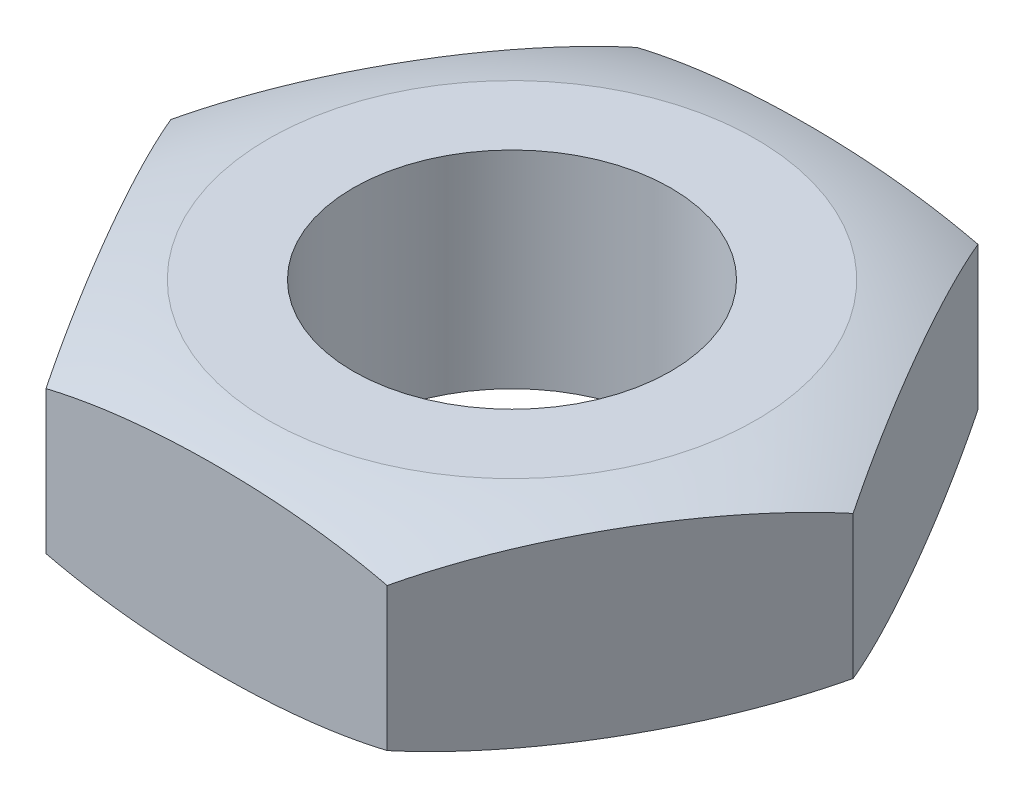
ISO-10303-21;
HEADER;
FILE_DESCRIPTION(('STEP AP214'),'2;1');
FILE_NAME('part.step','',(''),(''),'','','');
FILE_SCHEMA(('AUTOMOTIVE_DESIGN { 1 0 10303 214 1 1 1 1 }'));
ENDSEC;
DATA;
#1=APPLICATION_CONTEXT('core data for automotive mechanical design processes');
#2=APPLICATION_PROTOCOL_DEFINITION('international standard','automotive_design',2000,#1);
#3=PRODUCT_CONTEXT('',#1,'mechanical');
#4=PRODUCT('Part','Part','',(#3));
#5=PRODUCT_RELATED_PRODUCT_CATEGORY('part','',(#4));
#6=PRODUCT_DEFINITION_FORMATION('','',#4);
#7=PRODUCT_DEFINITION_CONTEXT('part definition',#1,'design');
#8=PRODUCT_DEFINITION('design','',#6,#7);
#9=PRODUCT_DEFINITION_SHAPE('','',#8);
#10=(LENGTH_UNIT() NAMED_UNIT(*) SI_UNIT(.MILLI.,.METRE.));
#11=(NAMED_UNIT(*) PLANE_ANGLE_UNIT() SI_UNIT($,.RADIAN.));
#12=(NAMED_UNIT(*) SI_UNIT($,.STERADIAN.) SOLID_ANGLE_UNIT());
#13=UNCERTAINTY_MEASURE_WITH_UNIT(LENGTH_MEASURE(1.E-05),#10,'distance_accuracy_value','');
#14=(GEOMETRIC_REPRESENTATION_CONTEXT(3) GLOBAL_UNCERTAINTY_ASSIGNED_CONTEXT((#13)) GLOBAL_UNIT_ASSIGNED_CONTEXT((#10,
#11,#12)) REPRESENTATION_CONTEXT('',''));
#15=CARTESIAN_POINT('',(0.,0.,0.));
#16=DIRECTION('',(0.,0.,1.));
#17=DIRECTION('',(1.,0.,0.));
#18=AXIS2_PLACEMENT_3D('',#15,#16,#17);
#19=CARTESIAN_POINT('',(18.3308710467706,11.1125,31.75));
#20=DIRECTION('',(-0.866025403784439,0.,-0.5));
#21=DIRECTION('',(-0.5,0.,0.866025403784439));
#22=AXIS2_PLACEMENT_3D('',#19,#20,#21);
#23=PLANE('',#22);
#24=CARTESIAN_POINT('',(36.6618575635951,-7.68333500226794,-0.000200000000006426));
#25=CARTESIAN_POINT('',(36.1144270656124,-7.94527960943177,0.947977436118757));
#26=CARTESIAN_POINT('',(35.5635412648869,-8.17694209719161,1.9021396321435));
#27=CARTESIAN_POINT('',(34.456943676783,-8.58481237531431,3.81882287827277));
#28=CARTESIAN_POINT('',(33.9012346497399,-8.76104997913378,4.78133914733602));
#29=CARTESIAN_POINT('',(32.7865447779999,-9.0634338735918,6.71203863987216));
#30=CARTESIAN_POINT('',(32.227564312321,-9.18958585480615,7.68022120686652));
#31=CARTESIAN_POINT('',(31.1074458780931,-9.39653238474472,9.62032324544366));
#32=CARTESIAN_POINT('',(30.5463075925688,-9.47731999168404,10.5922432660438));
#33=CARTESIAN_POINT('',(29.432748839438,-9.59601246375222,12.5209836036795));
#34=CARTESIAN_POINT('',(28.8803473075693,-9.63464174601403,13.477771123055));
#35=CARTESIAN_POINT('',(27.7752179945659,-9.67332929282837,15.3919112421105));
#36=CARTESIAN_POINT('',(27.222490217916,-9.67338807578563,16.3492638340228));
#37=CARTESIAN_POINT('',(26.1174380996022,-9.63494126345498,18.2632702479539));
#38=CARTESIAN_POINT('',(25.5651137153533,-9.59644060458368,19.2199241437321));
#39=CARTESIAN_POINT('',(24.4615778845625,-9.47907792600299,21.1313042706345));
#40=CARTESIAN_POINT('',(23.9103663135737,-9.40022070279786,22.086030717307));
#41=CARTESIAN_POINT('',(22.9384196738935,-9.22230491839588,23.7694916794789));
#42=CARTESIAN_POINT('',(22.5172705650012,-9.13226236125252,24.4989433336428));
#43=CARTESIAN_POINT('',(21.6768196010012,-8.92456744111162,25.9546471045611));
#44=CARTESIAN_POINT('',(21.2575171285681,-8.80692515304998,26.6809002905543));
#45=CARTESIAN_POINT('',(20.4184846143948,-8.5409762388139,28.1341472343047));
#46=CARTESIAN_POINT('',(19.9987701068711,-8.39247183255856,28.8611140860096));
#47=CARTESIAN_POINT('',(19.1622799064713,-8.06290017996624,30.3099576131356));
#48=CARTESIAN_POINT('',(18.7455062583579,-7.88181222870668,31.0318307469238));
#49=CARTESIAN_POINT('',(18.3307555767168,-7.68333500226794,31.7502));
#50=B_SPLINE_CURVE_WITH_KNOTS('',3,(#24,#25,#26,#27,#28,#29,#30,#31,#32,#33,#34,#35,#36,#37,#38,
#39,#40,#41,#42,#43,#44,#45,#46,#47,#48,#49),.UNSPECIFIED.,.F.,.F.,(4,2,2,2,2,2,2,2,2,2,2,2,4),
(0.,3.37637997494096,6.75094065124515,10.1251178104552,13.4998111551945,16.8155560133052,
20.1312563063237,23.4465321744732,26.7614141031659,29.3022990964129,31.8422580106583,
34.3990260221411,36.9574244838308),.UNSPECIFIED.);
#51=CARTESIAN_POINT('',(36.6617420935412,-7.68339026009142,0.));
#52=VERTEX_POINT('',#51);
#53=CARTESIAN_POINT('',(18.3308710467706,-7.68339026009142,31.75));
#54=VERTEX_POINT('',#53);
#55=EDGE_CURVE('E50',#52,#54,#50,.T.);
#56=ORIENTED_EDGE('',*,*,#55,.F.);
#57=DIRECTION('',(0.,-1.,0.));
#58=VECTOR('',#57,1.);
#59=CARTESIAN_POINT('',(36.6617420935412,11.1125,0.));
#60=LINE('',#59,#58);
#61=CARTESIAN_POINT('',(36.6617420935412,7.68339026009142,0.));
#62=VERTEX_POINT('',#61);
#63=EDGE_CURVE('E11',#62,#52,#60,.T.);
#64=ORIENTED_EDGE('',*,*,#63,.F.);
#65=CARTESIAN_POINT('',(18.3307555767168,7.68333500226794,31.7502));
#66=CARTESIAN_POINT('',(18.8781860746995,7.94527960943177,30.8020225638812));
#67=CARTESIAN_POINT('',(19.4290718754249,8.17694209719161,29.8478603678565));
#68=CARTESIAN_POINT('',(20.5356694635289,8.58481237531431,27.9311771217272));
#69=CARTESIAN_POINT('',(21.091378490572,8.76104997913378,26.968660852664));
#70=CARTESIAN_POINT('',(22.206068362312,9.0634338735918,25.0379613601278));
#71=CARTESIAN_POINT('',(22.7650488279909,9.18958585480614,24.0697787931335));
#72=CARTESIAN_POINT('',(23.8851672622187,9.39653238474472,22.1296767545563));
#73=CARTESIAN_POINT('',(24.446305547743,9.47731999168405,21.1577567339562));
#74=CARTESIAN_POINT('',(25.5598643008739,9.59601246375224,19.2290163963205));
#75=CARTESIAN_POINT('',(26.1122658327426,9.63464174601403,18.272228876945));
#76=CARTESIAN_POINT('',(27.217395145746,9.67332929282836,16.3580887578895));
#77=CARTESIAN_POINT('',(27.7701229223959,9.67338807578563,15.4007361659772));
#78=CARTESIAN_POINT('',(28.8751750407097,9.63494126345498,13.4867297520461));
#79=CARTESIAN_POINT('',(29.4274994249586,9.59644060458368,12.5300758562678));
#80=CARTESIAN_POINT('',(30.5310352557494,9.47907792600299,10.6186957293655));
#81=CARTESIAN_POINT('',(31.0822468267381,9.40022070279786,9.66396928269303));
#82=CARTESIAN_POINT('',(32.0541934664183,9.22230491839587,7.98050832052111));
#83=CARTESIAN_POINT('',(32.4753425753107,9.13226236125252,7.25105666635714));
#84=CARTESIAN_POINT('',(33.3157935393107,8.92456744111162,5.79535289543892));
#85=CARTESIAN_POINT('',(33.7350960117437,8.80692515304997,5.06909970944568));
#86=CARTESIAN_POINT('',(34.574128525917,8.5409762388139,3.61585276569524));
#87=CARTESIAN_POINT('',(34.9938430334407,8.39247183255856,2.88888591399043));
#88=CARTESIAN_POINT('',(35.8303332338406,8.06290017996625,1.44004238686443));
#89=CARTESIAN_POINT('',(36.247106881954,7.88181222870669,0.718169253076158));
#90=CARTESIAN_POINT('',(36.6618575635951,7.68333500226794,-0.000200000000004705));
#91=B_SPLINE_CURVE_WITH_KNOTS('',3,(#65,#66,#67,#68,#69,#70,#71,#72,#73,#74,#75,#76,#77,#78,#79,
#80,#81,#82,#83,#84,#85,#86,#87,#88,#89,#90),.UNSPECIFIED.,.F.,.F.,(4,2,2,2,2,2,2,2,2,2,2,2,4),
(0.,3.37637997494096,6.75094065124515,10.1251178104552,13.4998111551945,16.8155560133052,
20.1312563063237,23.4465321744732,26.7614141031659,29.3022990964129,31.8422580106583,
34.3990260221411,36.9574244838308),.UNSPECIFIED.);
#92=CARTESIAN_POINT('',(18.3308710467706,7.68339026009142,31.75));
#93=VERTEX_POINT('',#92);
#94=EDGE_CURVE('E179',#93,#62,#91,.T.);
#95=ORIENTED_EDGE('',*,*,#94,.F.);
#96=DIRECTION('',(0.,-1.,0.));
#97=VECTOR('',#96,1.);
#98=CARTESIAN_POINT('',(18.3308710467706,11.1125,31.75));
#99=LINE('',#98,#97);
#100=EDGE_CURVE('E190',#93,#54,#99,.T.);
#101=ORIENTED_EDGE('',*,*,#100,.T.);
#102=EDGE_LOOP('',(#56,#64,#95,#101));
#103=FACE_BOUND('',#102,.T.);
#104=ADVANCED_FACE('F33',(#103),#23,.F.);
#105=CARTESIAN_POINT('',(36.6617420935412,11.1125,0.));
#106=DIRECTION('',(-0.866025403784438,0.,0.5));
#107=DIRECTION('',(0.5,0.,0.866025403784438));
#108=AXIS2_PLACEMENT_3D('',#105,#106,#107);
#109=PLANE('',#108);
#110=CARTESIAN_POINT('',(18.3307555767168,-7.68333500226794,-31.7502));
#111=CARTESIAN_POINT('',(18.8781860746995,-7.94527960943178,-30.8020225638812));
#112=CARTESIAN_POINT('',(19.4290718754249,-8.17694209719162,-29.8478603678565));
#113=CARTESIAN_POINT('',(20.5356694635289,-8.58481237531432,-27.9311771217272));
#114=CARTESIAN_POINT('',(21.091378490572,-8.76104997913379,-26.968660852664));
#115=CARTESIAN_POINT('',(22.206068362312,-9.06343387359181,-25.0379613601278));
#116=CARTESIAN_POINT('',(22.7650488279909,-9.18958585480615,-24.0697787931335));
#117=CARTESIAN_POINT('',(23.8851672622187,-9.39653238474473,-22.1296767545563));
#118=CARTESIAN_POINT('',(24.446305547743,-9.47731999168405,-21.1577567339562));
#119=CARTESIAN_POINT('',(25.5598643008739,-9.59601246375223,-19.2290163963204));
#120=CARTESIAN_POINT('',(26.1122658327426,-9.63464174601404,-18.272228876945));
#121=CARTESIAN_POINT('',(27.217395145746,-9.67332929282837,-16.3580887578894));
#122=CARTESIAN_POINT('',(27.7701229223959,-9.67338807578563,-15.4007361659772));
#123=CARTESIAN_POINT('',(28.8751750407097,-9.63494126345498,-13.4867297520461));
#124=CARTESIAN_POINT('',(29.4274994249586,-9.59644060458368,-12.5300758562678));
#125=CARTESIAN_POINT('',(30.5310352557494,-9.47907792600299,-10.6186957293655));
#126=CARTESIAN_POINT('',(31.0822468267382,-9.40022070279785,-9.66396928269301));
#127=CARTESIAN_POINT('',(32.0541934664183,-9.22230491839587,-7.98050832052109));
#128=CARTESIAN_POINT('',(32.4753425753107,-9.13226236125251,-7.25105666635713));
#129=CARTESIAN_POINT('',(33.3157935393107,-8.92456744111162,-5.79535289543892));
#130=CARTESIAN_POINT('',(33.7350960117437,-8.80692515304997,-5.06909970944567));
#131=CARTESIAN_POINT('',(34.574128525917,-8.54097623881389,-3.61585276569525));
#132=CARTESIAN_POINT('',(34.9938430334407,-8.39247183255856,-2.88888591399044));
#133=CARTESIAN_POINT('',(35.8303332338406,-8.06290017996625,-1.44004238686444));
#134=CARTESIAN_POINT('',(36.247106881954,-7.88181222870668,-0.71816925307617));
#135=CARTESIAN_POINT('',(36.6618575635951,-7.68333500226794,0.000199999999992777));
#136=B_SPLINE_CURVE_WITH_KNOTS('',3,(#110,#111,#112,#113,#114,#115,#116,#117,#118,#119,#120,
#121,#122,#123,#124,#125,#126,#127,#128,#129,#130,#131,#132,#133,#134,#135),.UNSPECIFIED.,.F.,
.F.,(4,2,2,2,2,2,2,2,2,2,2,2,4),(0.,3.37637997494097,6.75094065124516,10.1251178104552,
13.4998111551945,16.8155560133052,20.1312563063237,23.4465321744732,26.7614141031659,
29.3022990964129,31.8422580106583,34.3990260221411,36.9574244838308),.UNSPECIFIED.);
#137=CARTESIAN_POINT('',(18.3308710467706,-7.68339026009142,-31.75));
#138=VERTEX_POINT('',#137);
#139=EDGE_CURVE('E89',#138,#52,#136,.T.);
#140=ORIENTED_EDGE('',*,*,#139,.F.);
#141=DIRECTION('',(0.,-1.,0.));
#142=VECTOR('',#141,1.);
#143=CARTESIAN_POINT('',(18.3308710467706,11.1125,-31.75));
#144=LINE('',#143,#142);
#145=CARTESIAN_POINT('',(18.3308710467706,7.68339026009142,-31.75));
#146=VERTEX_POINT('',#145);
#147=EDGE_CURVE('E42',#146,#138,#144,.T.);
#148=ORIENTED_EDGE('',*,*,#147,.F.);
#149=CARTESIAN_POINT('',(36.6618575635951,7.68333500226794,0.000199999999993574));
#150=CARTESIAN_POINT('',(36.1144270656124,7.94527960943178,-0.94797743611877));
#151=CARTESIAN_POINT('',(35.5635412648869,8.17694209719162,-1.90213963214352));
#152=CARTESIAN_POINT('',(34.4569436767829,8.58481237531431,-3.81882287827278));
#153=CARTESIAN_POINT('',(33.9012346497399,8.76104997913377,-4.78133914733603));
#154=CARTESIAN_POINT('',(32.7865447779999,9.0634338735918,-6.71203863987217));
#155=CARTESIAN_POINT('',(32.227564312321,9.18958585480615,-7.68022120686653));
#156=CARTESIAN_POINT('',(31.1074458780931,9.39653238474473,-9.62032324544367));
#157=CARTESIAN_POINT('',(30.5463075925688,9.47731999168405,-10.5922432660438));
#158=CARTESIAN_POINT('',(29.432748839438,9.59601246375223,-12.5209836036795));
#159=CARTESIAN_POINT('',(28.8803473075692,9.63464174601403,-13.477771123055));
#160=CARTESIAN_POINT('',(27.7752179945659,9.67332929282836,-15.3919112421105));
#161=CARTESIAN_POINT('',(27.222490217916,9.67338807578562,-16.3492638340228));
#162=CARTESIAN_POINT('',(26.1174380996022,9.63494126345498,-18.2632702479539));
#163=CARTESIAN_POINT('',(25.5651137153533,9.59644060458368,-19.2199241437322));
#164=CARTESIAN_POINT('',(24.4615778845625,9.479077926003,-21.1313042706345));
#165=CARTESIAN_POINT('',(23.9103663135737,9.40022070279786,-22.086030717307));
#166=CARTESIAN_POINT('',(22.9384196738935,9.22230491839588,-23.7694916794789));
#167=CARTESIAN_POINT('',(22.5172705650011,9.13226236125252,-24.4989433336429));
#168=CARTESIAN_POINT('',(21.6768196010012,8.92456744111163,-25.9546471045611));
#169=CARTESIAN_POINT('',(21.2575171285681,8.80692515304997,-26.6809002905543));
#170=CARTESIAN_POINT('',(20.4184846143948,8.5409762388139,-28.1341472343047));
#171=CARTESIAN_POINT('',(19.9987701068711,8.39247183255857,-28.8611140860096));
#172=CARTESIAN_POINT('',(19.1622799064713,8.06290017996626,-30.3099576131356));
#173=CARTESIAN_POINT('',(18.7455062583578,7.8818122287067,-31.0318307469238));
#174=CARTESIAN_POINT('',(18.3307555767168,7.68333500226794,-31.7502));
#175=B_SPLINE_CURVE_WITH_KNOTS('',3,(#149,#150,#151,#152,#153,#154,#155,#156,#157,#158,#159,
#160,#161,#162,#163,#164,#165,#166,#167,#168,#169,#170,#171,#172,#173,#174),.UNSPECIFIED.,.F.,
.F.,(4,2,2,2,2,2,2,2,2,2,2,2,4),(0.,3.37637997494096,6.75094065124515,10.1251178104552,
13.4998111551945,16.8155560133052,20.1312563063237,23.4465321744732,26.7614141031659,
29.3022990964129,31.8422580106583,34.3990260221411,36.9574244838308),.UNSPECIFIED.);
#176=EDGE_CURVE('E170',#62,#146,#175,.T.);
#177=ORIENTED_EDGE('',*,*,#176,.F.);
#178=ORIENTED_EDGE('',*,*,#63,.T.);
#179=EDGE_LOOP('',(#140,#148,#177,#178));
#180=FACE_BOUND('',#179,.T.);
#181=ADVANCED_FACE('F99',(#180),#109,.F.);
#182=CARTESIAN_POINT('',(18.3308710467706,11.1125,-31.75));
#183=DIRECTION('',(0.,0.,1.));
#184=DIRECTION('',(1.,0.,0.));
#185=AXIS2_PLACEMENT_3D('',#182,#183,#184);
#186=PLANE('',#185);
#187=CARTESIAN_POINT('',(0.,-9.66852259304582,-31.75));
#188=CARTESIAN_POINT('',(0.966789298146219,-9.6685254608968,-31.75));
#189=CARTESIAN_POINT('',(1.93358718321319,-9.653844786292,-31.75));
#190=CARTESIAN_POINT('',(3.86628394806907,-9.59458621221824,-31.75));
#191=CARTESIAN_POINT('',(4.8321828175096,-9.55000797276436,-31.75));
#192=CARTESIAN_POINT('',(6.76225393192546,-9.42937468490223,-31.75));
#193=CARTESIAN_POINT('',(7.72642574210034,-9.35331259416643,-31.75));
#194=CARTESIAN_POINT('',(9.65153540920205,-9.16730681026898,-31.75));
#195=CARTESIAN_POINT('',(10.6124732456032,-9.05736290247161,-31.75));
#196=CARTESIAN_POINT('',(12.5253825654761,-8.80114781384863,-31.75));
#197=CARTESIAN_POINT('',(13.4773747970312,-8.65503291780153,-31.75));
#198=CARTESIAN_POINT('',(15.3743867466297,-8.32300273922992,-31.75));
#199=CARTESIAN_POINT('',(16.3194068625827,-8.1370897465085,-31.75));
#200=CARTESIAN_POINT('',(18.1993210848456,-7.72232434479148,-31.75));
#201=CARTESIAN_POINT('',(19.1342220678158,-7.49350332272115,-31.75));
#202=CARTESIAN_POINT('',(20.9917473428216,-6.98972149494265,-31.75));
#203=CARTESIAN_POINT('',(21.9143690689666,-6.71475120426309,-31.75));
#204=CARTESIAN_POINT('',(24.015532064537,-6.02700758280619,-31.75));
#205=CARTESIAN_POINT('',(25.1886791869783,-5.59756323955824,-31.75));
#206=CARTESIAN_POINT('',(27.4993999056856,-4.65196572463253,-31.75));
#207=CARTESIAN_POINT('',(28.6369841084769,-4.13583870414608,-31.75));
#208=CARTESIAN_POINT('',(30.3096846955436,-3.29458222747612,-31.75));
#209=CARTESIAN_POINT('',(30.8618008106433,-3.00288737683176,-31.75));
#210=CARTESIAN_POINT('',(31.9535012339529,-2.39700142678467,-31.75));
#211=CARTESIAN_POINT('',(32.4930871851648,-2.08281329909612,-31.75));
#212=CARTESIAN_POINT('',(33.55852005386,-1.43185308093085,-31.75));
#213=CARTESIAN_POINT('',(34.0843658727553,-1.095079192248,-31.75));
#214=CARTESIAN_POINT('',(35.1209958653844,-0.399041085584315,-31.75));
#215=CARTESIAN_POINT('',(35.6317795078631,-0.0397760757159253,-31.75));
#216=CARTESIAN_POINT('',(36.6406756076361,0.703768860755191,-31.75));
#217=CARTESIAN_POINT('',(37.1386659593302,1.08821458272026,-31.75));
#218=CARTESIAN_POINT('',(38.1167044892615,1.87939822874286,-31.75));
#219=CARTESIAN_POINT('',(38.5967508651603,2.28613838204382,-31.75));
#220=CARTESIAN_POINT('',(39.5374859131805,3.12138110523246,-31.75));
#221=CARTESIAN_POINT('',(39.9981756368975,3.5498824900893,-31.75));
#222=CARTESIAN_POINT('',(40.8989551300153,4.42811904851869,-31.75));
#223=CARTESIAN_POINT('',(41.339042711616,4.87785646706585,-31.75));
#224=CARTESIAN_POINT('',(42.1971824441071,5.79770725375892,-31.75));
#225=CARTESIAN_POINT('',(42.6152394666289,6.26781607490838,-31.75));
#226=CARTESIAN_POINT('',(43.4282219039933,7.22772862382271,-31.75));
#227=CARTESIAN_POINT('',(43.8231444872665,7.71753475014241,-31.75));
#228=CARTESIAN_POINT('',(44.588524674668,8.71575643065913,-31.75));
#229=CARTESIAN_POINT('',(44.9589875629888,9.22416792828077,-31.75));
#230=CARTESIAN_POINT('',(45.6744035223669,10.2586512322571,-31.75));
#231=CARTESIAN_POINT('',(46.0193542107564,10.784724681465,-31.75));
#232=CARTESIAN_POINT('',(46.9417552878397,12.270915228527,-31.75));
#233=CARTESIAN_POINT('',(47.490393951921,13.2491519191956,-31.75));
#234=CARTESIAN_POINT('',(48.4975166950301,15.2507746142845,-31.75));
#235=CARTESIAN_POINT('',(48.9560074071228,16.2741572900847,-31.75));
#236=CARTESIAN_POINT('',(49.7780885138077,18.3579066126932,-31.75));
#237=CARTESIAN_POINT('',(50.1417198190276,19.4182570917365,-31.75));
#238=CARTESIAN_POINT('',(50.770507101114,21.5677559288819,-31.75));
#239=CARTESIAN_POINT('',(51.0356670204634,22.6569031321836,-31.75));
#240=CARTESIAN_POINT('',(51.4500288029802,24.7795467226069,-31.75));
#241=CARTESIAN_POINT('',(51.6059336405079,25.8117398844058,-31.75));
#242=CARTESIAN_POINT('',(51.8284867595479,27.8856736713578,-31.75));
#243=CARTESIAN_POINT('',(51.8951399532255,28.9274137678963,-31.75));
#244=CARTESIAN_POINT('',(51.9385805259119,31.0126361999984,-31.75));
#245=CARTESIAN_POINT('',(51.9153785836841,32.0561183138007,-31.75));
#246=CARTESIAN_POINT('',(51.779347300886,34.1372280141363,-31.75));
#247=CARTESIAN_POINT('',(51.6665179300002,35.1748555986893,-31.75));
#248=CARTESIAN_POINT('',(51.3553509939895,37.2164167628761,-31.75));
#249=CARTESIAN_POINT('',(51.1587290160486,38.2206124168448,-31.75));
#250=CARTESIAN_POINT('',(50.6820727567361,40.2089797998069,-31.75));
#251=CARTESIAN_POINT('',(50.4020401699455,41.1931519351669,-31.75));
#252=CARTESIAN_POINT('',(49.7610604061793,43.1346017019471,-31.75));
#253=CARTESIAN_POINT('',(49.4001253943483,44.0918833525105,-31.75));
#254=CARTESIAN_POINT('',(48.6004402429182,45.9733621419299,-31.75));
#255=CARTESIAN_POINT('',(48.1616890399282,46.8975588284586,-31.75));
#256=CARTESIAN_POINT('',(47.2045702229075,48.7175300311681,-31.75));
#257=CARTESIAN_POINT('',(46.6853340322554,49.612847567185,-31.75));
#258=CARTESIAN_POINT('',(45.5755277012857,51.3580767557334,-31.75));
#259=CARTESIAN_POINT('',(44.984957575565,52.2079884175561,-31.75));
#260=CARTESIAN_POINT('',(43.737182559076,53.857933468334,-31.75));
#261=CARTESIAN_POINT('',(43.0799490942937,54.6579452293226,-31.75));
#262=CARTESIAN_POINT('',(41.7044431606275,56.2036192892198,-31.75));
#263=CARTESIAN_POINT('',(40.9861687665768,56.9492798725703,-31.75));
#264=CARTESIAN_POINT('',(39.4590032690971,58.4168769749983,-31.75));
#265=CARTESIAN_POINT('',(38.6474334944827,59.1360252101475,-31.75));
#266=CARTESIAN_POINT('',(36.970419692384,60.5083640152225,-31.75));
#267=CARTESIAN_POINT('',(36.1049756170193,61.1615545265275,-31.75));
#268=CARTESIAN_POINT('',(34.3281778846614,62.3996334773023,-31.75));
#269=CARTESIAN_POINT('',(33.4168801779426,62.9846023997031,-31.75));
#270=CARTESIAN_POINT('',(31.5540610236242,64.0867604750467,-31.75));
#271=CARTESIAN_POINT('',(30.6025345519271,64.6039411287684,-31.75));
#272=CARTESIAN_POINT('',(28.9553932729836,65.4265842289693,-31.75));
#273=CARTESIAN_POINT('',(28.2682331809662,65.7491435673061,-31.75));
#274=CARTESIAN_POINT('',(26.8795299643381,66.3618349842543,-31.75));
#275=CARTESIAN_POINT('',(26.1779857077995,66.6519644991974,-31.75));
#276=CARTESIAN_POINT('',(24.7625315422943,67.2006028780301,-31.75));
#277=CARTESIAN_POINT('',(24.048619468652,67.4591061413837,-31.75));
#278=CARTESIAN_POINT('',(22.6103685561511,67.9455161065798,-31.75));
#279=CARTESIAN_POINT('',(21.8860283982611,68.1734188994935,-31.75));
#280=CARTESIAN_POINT('',(20.4249225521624,68.600969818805,-31.75));
#281=CARTESIAN_POINT('',(19.6881114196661,68.8004622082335,-31.75));
#282=CARTESIAN_POINT('',(18.2074131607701,69.1712087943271,-31.75));
#283=CARTESIAN_POINT('',(17.4635257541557,69.3424618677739,-31.75));
#284=CARTESIAN_POINT('',(15.9701736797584,69.6582855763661,-31.75));
#285=CARTESIAN_POINT('',(15.2207093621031,69.8028578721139,-31.75));
#286=CARTESIAN_POINT('',(13.7173970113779,70.0669633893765,-31.75));
#287=CARTESIAN_POINT('',(12.9635488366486,70.1864957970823,-31.75));
#288=CARTESIAN_POINT('',(10.9765212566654,70.4701044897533,-31.75));
#289=CARTESIAN_POINT('',(9.74053079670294,70.614808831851,-31.75));
#290=CARTESIAN_POINT('',(7.8827066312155,70.7900341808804,-31.75));
#291=CARTESIAN_POINT('',(7.26272028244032,70.8414742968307,-31.75));
#292=CARTESIAN_POINT('',(6.02178771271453,70.9310509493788,-31.75));
#293=CARTESIAN_POINT('',(5.400841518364,70.969187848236,-31.75));
#294=CARTESIAN_POINT('',(4.15760624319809,71.0327251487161,-31.75));
#295=CARTESIAN_POINT('',(3.53531643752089,71.0581111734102,-31.75));
#296=CARTESIAN_POINT('',(2.29035316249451,71.0964536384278,-31.75));
#297=CARTESIAN_POINT('',(1.66767969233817,71.109410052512,-31.75));
#298=CARTESIAN_POINT('',(0.422234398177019,71.1230893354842,-31.75));
#299=CARTESIAN_POINT('',(-0.200537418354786,71.1238128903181,-31.75));
#300=CARTESIAN_POINT('',(-1.44597552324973,71.1130392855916,-31.75));
#301=CARTESIAN_POINT('',(-2.06864181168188,71.1015421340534,-31.75));
#302=CARTESIAN_POINT('',(-3.3120659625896,71.0661967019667,-31.75));
#303=CARTESIAN_POINT('',(-3.93282470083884,71.0423794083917,-31.75));
#304=CARTESIAN_POINT('',(-5.17374020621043,70.9820617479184,-31.75));
#305=CARTESIAN_POINT('',(-5.7938969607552,70.9455611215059,-31.75));
#306=CARTESIAN_POINT('',(-7.0333334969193,70.8593675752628,-31.75));
#307=CARTESIAN_POINT('',(-7.65261323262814,70.8096739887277,-31.75));
#308=CARTESIAN_POINT('',(-8.88990852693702,70.6964513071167,-31.75));
#309=CARTESIAN_POINT('',(-9.50792405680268,70.6329219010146,-31.75));
#310=CARTESIAN_POINT('',(-11.3577370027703,70.4206719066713,-31.75));
#311=CARTESIAN_POINT('',(-12.5871427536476,70.2501657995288,-31.75));
#312=CARTESIAN_POINT('',(-15.0349798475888,69.8443153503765,-31.75));
#313=CARTESIAN_POINT('',(-16.2534137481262,69.6089865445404,-31.75));
#314=CARTESIAN_POINT('',(-18.7460673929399,69.0503239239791,-31.75));
#315=CARTESIAN_POINT('',(-20.0193177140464,68.7226037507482,-31.75));
#316=CARTESIAN_POINT('',(-22.5399533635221,67.9788216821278,-31.75));
#317=CARTESIAN_POINT('',(-23.7873388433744,67.5627603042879,-31.75));
#318=CARTESIAN_POINT('',(-26.2440687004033,66.6372104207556,-31.75));
#319=CARTESIAN_POINT('',(-27.4534903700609,66.1279284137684,-31.75));
#320=CARTESIAN_POINT('',(-29.8264231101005,65.0113383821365,-31.75));
#321=CARTESIAN_POINT('',(-30.9899342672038,64.4040305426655,-31.75));
#322=CARTESIAN_POINT('',(-33.2713539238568,63.0828140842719,-31.75));
#323=CARTESIAN_POINT('',(-34.3886558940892,62.3678538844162,-31.75));
#324=CARTESIAN_POINT('',(-36.5520487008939,60.8369207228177,-31.75));
#325=CARTESIAN_POINT('',(-37.5981369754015,60.0209441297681,-31.75));
#326=CARTESIAN_POINT('',(-39.6071768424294,58.2907528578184,-31.75));
#327=CARTESIAN_POINT('',(-40.5700666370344,57.3764662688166,-31.75));
#328=CARTESIAN_POINT('',(-42.3994378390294,55.4560535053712,-31.75));
#329=CARTESIAN_POINT('',(-43.2659334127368,54.4499408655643,-31.75));
#330=CARTESIAN_POINT('',(-44.7914610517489,52.4824492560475,-31.75));
#331=CARTESIAN_POINT('',(-45.4629049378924,51.530671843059,-31.75));
#332=CARTESIAN_POINT('',(-46.7155907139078,49.5694892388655,-31.75));
#333=CARTESIAN_POINT('',(-47.2968398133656,48.560088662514,-31.75));
#334=CARTESIAN_POINT('',(-48.3624087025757,46.4923232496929,-31.75));
#335=CARTESIAN_POINT('',(-48.846802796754,45.4339967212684,-31.75));
#336=CARTESIAN_POINT('',(-49.7138434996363,43.2764551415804,-31.75));
#337=CARTESIAN_POINT('',(-50.0964966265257,42.1772427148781,-31.75));
#338=CARTESIAN_POINT('',(-50.7256562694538,40.0493937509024,-31.75));
#339=CARTESIAN_POINT('',(-50.9814048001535,39.0234792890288,-31.75));
#340=CARTESIAN_POINT('',(-51.4029871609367,36.9533744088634,-31.75));
#341=CARTESIAN_POINT('',(-51.5688275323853,35.9091853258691,-31.75));
#342=CARTESIAN_POINT('',(-51.8090253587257,33.8104928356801,-31.75));
#343=CARTESIAN_POINT('',(-51.8833959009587,32.7559909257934,-31.75));
#344=CARTESIAN_POINT('',(-51.9399957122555,30.6445084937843,-31.75));
#345=CARTESIAN_POINT('',(-51.9222253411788,29.5875279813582,-31.75));
#346=CARTESIAN_POINT('',(-51.7966384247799,27.5109090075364,-31.75));
#347=CARTESIAN_POINT('',(-51.6915492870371,26.4911044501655,-31.75));
#348=CARTESIAN_POINT('',(-51.3958013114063,24.4640074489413,-31.75));
#349=CARTESIAN_POINT('',(-51.2051448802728,23.4567146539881,-31.75));
#350=CARTESIAN_POINT('',(-50.7399701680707,21.4617882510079,-31.75));
#351=CARTESIAN_POINT('',(-50.4654590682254,20.4741529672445,-31.75));
#352=CARTESIAN_POINT('',(-49.8349800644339,18.5252402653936,-31.75));
#353=CARTESIAN_POINT('',(-49.4790113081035,17.5639631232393,-31.75));
#354=CARTESIAN_POINT('',(-48.687223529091,15.6706326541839,-31.75));
#355=CARTESIAN_POINT('',(-48.2511083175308,14.7387032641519,-31.75));
#356=CARTESIAN_POINT('',(-47.3037046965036,12.9139097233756,-31.75));
#357=CARTESIAN_POINT('',(-46.7924166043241,12.0210454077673,-31.75));
#358=CARTESIAN_POINT('',(-45.6989859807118,10.2797802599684,-31.75));
#359=CARTESIAN_POINT('',(-45.1168396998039,9.43138178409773,-31.75));
#360=CARTESIAN_POINT('',(-43.8865614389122,7.78388878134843,-31.75));
#361=CARTESIAN_POINT('',(-43.2384279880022,6.98479535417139,-31.75));
#362=CARTESIAN_POINT('',(-41.8569484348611,5.41211798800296,-31.75));
#363=CARTESIAN_POINT('',(-41.1213719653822,4.6404938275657,-31.75));
#364=CARTESIAN_POINT('',(-39.5912485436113,3.15819046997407,-31.75));
#365=CARTESIAN_POINT('',(-38.7967005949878,2.44751230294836,-31.75));
#366=CARTESIAN_POINT('',(-37.1550534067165,1.08972338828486,-31.75));
#367=CARTESIAN_POINT('',(-36.3079522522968,0.442614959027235,-31.75));
#368=CARTESIAN_POINT('',(-34.5677690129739,-0.786403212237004,-31.75));
#369=CARTESIAN_POINT('',(-33.6746854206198,-1.36831081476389,-31.75));
#370=CARTESIAN_POINT('',(-31.7694094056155,-2.5142575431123,-31.75));
#371=CARTESIAN_POINT('',(-30.753621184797,-3.07231502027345,-31.75));
#372=CARTESIAN_POINT('',(-28.6834817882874,-4.11141777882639,-31.75));
#373=CARTESIAN_POINT('',(-27.6291286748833,-4.59245918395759,-31.75));
#374=CARTESIAN_POINT('',(-25.4895885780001,-5.47967344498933,-31.75));
#375=CARTESIAN_POINT('',(-24.4044033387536,-5.88585052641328,-31.75));
#376=CARTESIAN_POINT('',(-22.2099958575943,-6.62691392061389,-31.75));
#377=CARTESIAN_POINT('',(-21.1007724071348,-6.96179663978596,-31.75));
#378=CARTESIAN_POINT('',(-19.1724633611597,-7.48183471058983,-31.75));
#379=CARTESIAN_POINT('',(-18.3575839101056,-7.68282781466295,-31.75));
#380=CARTESIAN_POINT('',(-16.720341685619,-8.05187861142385,-31.75));
#381=CARTESIAN_POINT('',(-15.897978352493,-8.21993381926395,-31.75));
#382=CARTESIAN_POINT('',(-14.2473271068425,-8.52528435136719,-31.75));
#383=CARTESIAN_POINT('',(-13.4190373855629,-8.6625698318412,-31.75));
#384=CARTESIAN_POINT('',(-11.7582541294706,-8.90848877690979,-31.75));
#385=CARTESIAN_POINT('',(-10.9257606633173,-9.01712270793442,-31.75));
#386=CARTESIAN_POINT('',(-9.25448267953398,-9.20817474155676,-31.75));
#387=CARTESIAN_POINT('',(-8.41568629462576,-9.2904882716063,-31.75));
#388=CARTESIAN_POINT('',(-6.73603202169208,-9.43014205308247,-31.75));
#389=CARTESIAN_POINT('',(-5.8951741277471,-9.48748223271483,-31.75));
#390=CARTESIAN_POINT('',(-4.21223381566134,-9.57861515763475,-31.75));
#391=CARTESIAN_POINT('',(-3.37015145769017,-9.61240902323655,-31.75));
#392=CARTESIAN_POINT('',(-1.68538157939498,-9.65736163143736,-31.75));
#393=CARTESIAN_POINT('',(-0.842694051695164,-9.66852009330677,-31.75));
#394=CARTESIAN_POINT('',(0.,-9.66852259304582,-31.75));
#395=B_SPLINE_CURVE_WITH_KNOTS('',3,(#187,#188,#189,#190,#191,#192,#193,#194,#195,#196,#197,
#198,#199,#200,#201,#202,#203,#204,#205,#206,#207,#208,#209,#210,#211,#212,#213,#214,#215,#216,
#217,#218,#219,#220,#221,#222,#223,#224,#225,#226,#227,#228,#229,#230,#231,#232,#233,#234,#235,
#236,#237,#238,#239,#240,#241,#242,#243,#244,#245,#246,#247,#248,#249,#250,#251,#252,#253,#254,
#255,#256,#257,#258,#259,#260,#261,#262,#263,#264,#265,#266,#267,#268,#269,#270,#271,#272,#273,
#274,#275,#276,#277,#278,#279,#280,#281,#282,#283,#284,#285,#286,#287,#288,#289,#290,#291,#292,
#293,#294,#295,#296,#297,#298,#299,#300,#301,#302,#303,#304,#305,#306,#307,#308,#309,#310,#311,
#312,#313,#314,#315,#316,#317,#318,#319,#320,#321,#322,#323,#324,#325,#326,#327,#328,#329,#330,
#331,#332,#333,#334,#335,#336,#337,#338,#339,#340,#341,#342,#343,#344,#345,#346,#347,#348,#349,
#350,#351,#352,#353,#354,#355,#356,#357,#358,#359,#360,#361,#362,#363,#364,#365,#366,#367,#368,
#369,#370,#371,#372,#373,#374,#375,#376,#377,#378,#379,#380,#381,#382,#383,#384,#385,#386,#387,
#388,#389,#390,#391,#392,#393,#394),.UNSPECIFIED.,.T.,.F.,(4,2,2,2,2,2,2,2,2,2,2,2,2,2,2,2,2,2,
2,2,2,2,2,2,2,2,2,2,2,2,2,2,2,2,2,2,2,2,2,2,2,2,2,2,2,2,2,2,2,2,2,2,2,2,2,2,2,2,2,2,2,2,2,2,2,2,
2,2,2,2,2,2,2,2,2,2,2,2,2,2,2,2,2,2,2,2,2,2,2,2,2,2,2,2,2,2,2,2,2,2,2,2,2,4),(0.,
2.90026852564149,5.80057003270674,8.70152063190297,11.6024896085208,14.4911366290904,
17.3796174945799,20.2659936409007,23.1529637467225,26.8975488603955,30.6410062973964,
32.5138681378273,34.3864829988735,36.2592471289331,38.1320772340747,40.0188003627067,
41.9057124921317,43.792521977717,45.6795313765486,47.5661217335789,49.4529425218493,
51.3393543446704,53.2259421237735,56.5858781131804,59.9455667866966,63.303804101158,
66.661906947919,69.7898091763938,72.9175392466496,76.0448976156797,79.1722570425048,
82.2384495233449,85.3045797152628,88.3702491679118,91.4359605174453,94.5374136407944,
97.6388661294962,100.741653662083,103.844539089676,107.094121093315,110.343705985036,
113.589417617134,116.835535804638,119.112051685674,121.388747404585,123.665845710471,
125.943234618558,128.23266290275,130.522182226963,132.811559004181,135.101010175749,
138.832646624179,140.698896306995,142.565095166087,144.4333935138,146.301695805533,
148.169893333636,150.038089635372,151.901609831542,153.765168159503,155.628820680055,
157.492515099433,161.214370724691,164.935335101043,168.87665511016,172.817952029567,
176.750621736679,180.683284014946,184.657206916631,188.631272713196,192.608265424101,
196.584672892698,200.074296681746,203.563641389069,207.050298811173,210.536732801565,
213.704776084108,216.872588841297,220.039948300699,223.207295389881,226.279273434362,
229.351165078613,232.422793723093,235.494454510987,238.577703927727,241.660940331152,
244.744339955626,247.827808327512,251.022497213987,254.217240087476,257.412099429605,
260.607063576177,264.080596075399,267.554303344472,271.027814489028,274.50150067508,
277.01874075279,279.536170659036,282.054404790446,284.572597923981,287.100675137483,
289.628759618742,292.156723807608,294.684719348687),.UNSPECIFIED.);
#396=CARTESIAN_POINT('',(-18.3308710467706,-7.68339026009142,-31.75));
#397=VERTEX_POINT('',#396);
#398=EDGE_CURVE('E86',#397,#138,#395,.T.);
#399=ORIENTED_EDGE('',*,*,#398,.F.);
#400=DIRECTION('',(0.,-1.,0.));
#401=VECTOR('',#400,1.);
#402=CARTESIAN_POINT('',(-18.3308710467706,11.1125,-31.75));
#403=LINE('',#402,#401);
#404=CARTESIAN_POINT('',(-18.3308710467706,7.68339026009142,-31.75));
#405=VERTEX_POINT('',#404);
#406=EDGE_CURVE('E106',#405,#397,#403,.T.);
#407=ORIENTED_EDGE('',*,*,#406,.F.);
#408=CARTESIAN_POINT('',(0.,9.66852259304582,-31.75));
#409=CARTESIAN_POINT('',(-0.966789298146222,9.6685254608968,-31.75));
#410=CARTESIAN_POINT('',(-1.93358718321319,9.653844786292,-31.75));
#411=CARTESIAN_POINT('',(-3.86628394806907,9.59458621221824,-31.75));
#412=CARTESIAN_POINT('',(-4.83218281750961,9.55000797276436,-31.75));
#413=CARTESIAN_POINT('',(-6.76225393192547,9.42937468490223,-31.75));
#414=CARTESIAN_POINT('',(-7.72642574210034,9.35331259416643,-31.75));
#415=CARTESIAN_POINT('',(-9.65153540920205,9.16730681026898,-31.75));
#416=CARTESIAN_POINT('',(-10.6124732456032,9.05736290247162,-31.75));
#417=CARTESIAN_POINT('',(-12.5253825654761,8.80114781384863,-31.75));
#418=CARTESIAN_POINT('',(-13.4773747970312,8.65503291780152,-31.75));
#419=CARTESIAN_POINT('',(-15.3743867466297,8.32300273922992,-31.75));
#420=CARTESIAN_POINT('',(-16.3194068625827,8.13708974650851,-31.75));
#421=CARTESIAN_POINT('',(-18.1993210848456,7.72232434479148,-31.75));
#422=CARTESIAN_POINT('',(-19.1342220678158,7.49350332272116,-31.75));
#423=CARTESIAN_POINT('',(-20.9917473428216,6.98972149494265,-31.75));
#424=CARTESIAN_POINT('',(-21.9143690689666,6.71475120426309,-31.75));
#425=CARTESIAN_POINT('',(-24.015532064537,6.02700758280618,-31.75));
#426=CARTESIAN_POINT('',(-25.1886791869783,5.59756323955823,-31.75));
#427=CARTESIAN_POINT('',(-27.4993999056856,4.65196572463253,-31.75));
#428=CARTESIAN_POINT('',(-28.6369841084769,4.13583870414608,-31.75));
#429=CARTESIAN_POINT('',(-30.3096846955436,3.29458222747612,-31.75));
#430=CARTESIAN_POINT('',(-30.8618008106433,3.00288737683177,-31.75));
#431=CARTESIAN_POINT('',(-31.9535012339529,2.39700142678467,-31.75));
#432=CARTESIAN_POINT('',(-32.4930871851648,2.08281329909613,-31.75));
#433=CARTESIAN_POINT('',(-33.55852005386,1.43185308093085,-31.75));
#434=CARTESIAN_POINT('',(-34.0843658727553,1.09507919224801,-31.75));
#435=CARTESIAN_POINT('',(-35.1209958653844,0.399041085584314,-31.75));
#436=CARTESIAN_POINT('',(-35.6317795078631,0.0397760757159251,-31.75));
#437=CARTESIAN_POINT('',(-36.6406756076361,-0.703768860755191,-31.75));
#438=CARTESIAN_POINT('',(-37.1386659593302,-1.08821458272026,-31.75));
#439=CARTESIAN_POINT('',(-38.1167044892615,-1.87939822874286,-31.75));
#440=CARTESIAN_POINT('',(-38.5967508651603,-2.28613838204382,-31.75));
#441=CARTESIAN_POINT('',(-39.5374859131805,-3.12138110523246,-31.75));
#442=CARTESIAN_POINT('',(-39.9981756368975,-3.5498824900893,-31.75));
#443=CARTESIAN_POINT('',(-40.8989551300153,-4.4281190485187,-31.75));
#444=CARTESIAN_POINT('',(-41.339042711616,-4.87785646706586,-31.75));
#445=CARTESIAN_POINT('',(-42.1971824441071,-5.79770725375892,-31.75));
#446=CARTESIAN_POINT('',(-42.6152394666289,-6.26781607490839,-31.75));
#447=CARTESIAN_POINT('',(-43.4282219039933,-7.22772862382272,-31.75));
#448=CARTESIAN_POINT('',(-43.8231444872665,-7.71753475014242,-31.75));
#449=CARTESIAN_POINT('',(-44.588524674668,-8.71575643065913,-31.75));
#450=CARTESIAN_POINT('',(-44.9589875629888,-9.22416792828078,-31.75));
#451=CARTESIAN_POINT('',(-45.6744035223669,-10.2586512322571,-31.75));
#452=CARTESIAN_POINT('',(-46.0193542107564,-10.784724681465,-31.75));
#453=CARTESIAN_POINT('',(-46.9417552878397,-12.270915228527,-31.75));
#454=CARTESIAN_POINT('',(-47.490393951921,-13.2491519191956,-31.75));
#455=CARTESIAN_POINT('',(-48.4975166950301,-15.2507746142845,-31.75));
#456=CARTESIAN_POINT('',(-48.9560074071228,-16.2741572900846,-31.75));
#457=CARTESIAN_POINT('',(-49.7780885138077,-18.3579066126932,-31.75));
#458=CARTESIAN_POINT('',(-50.1417198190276,-19.4182570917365,-31.75));
#459=CARTESIAN_POINT('',(-50.770507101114,-21.5677559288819,-31.75));
#460=CARTESIAN_POINT('',(-51.0356670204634,-22.6569031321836,-31.75));
#461=CARTESIAN_POINT('',(-51.4500288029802,-24.7795467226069,-31.75));
#462=CARTESIAN_POINT('',(-51.6059336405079,-25.8117398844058,-31.75));
#463=CARTESIAN_POINT('',(-51.8284867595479,-27.8856736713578,-31.75));
#464=CARTESIAN_POINT('',(-51.8951399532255,-28.9274137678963,-31.75));
#465=CARTESIAN_POINT('',(-51.9385805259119,-31.0126361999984,-31.75));
#466=CARTESIAN_POINT('',(-51.9153785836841,-32.0561183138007,-31.75));
#467=CARTESIAN_POINT('',(-51.779347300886,-34.1372280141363,-31.75));
#468=CARTESIAN_POINT('',(-51.6665179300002,-35.1748555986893,-31.75));
#469=CARTESIAN_POINT('',(-51.3553509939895,-37.2164167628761,-31.75));
#470=CARTESIAN_POINT('',(-51.1587290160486,-38.2206124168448,-31.75));
#471=CARTESIAN_POINT('',(-50.6820727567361,-40.2089797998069,-31.75));
#472=CARTESIAN_POINT('',(-50.4020401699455,-41.1931519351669,-31.75));
#473=CARTESIAN_POINT('',(-49.7610604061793,-43.1346017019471,-31.75));
#474=CARTESIAN_POINT('',(-49.4001253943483,-44.0918833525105,-31.75));
#475=CARTESIAN_POINT('',(-48.6004402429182,-45.9733621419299,-31.75));
#476=CARTESIAN_POINT('',(-48.1616890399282,-46.8975588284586,-31.75));
#477=CARTESIAN_POINT('',(-47.2045702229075,-48.7175300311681,-31.75));
#478=CARTESIAN_POINT('',(-46.6853340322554,-49.612847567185,-31.75));
#479=CARTESIAN_POINT('',(-45.5755277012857,-51.3580767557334,-31.75));
#480=CARTESIAN_POINT('',(-44.984957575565,-52.2079884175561,-31.75));
#481=CARTESIAN_POINT('',(-43.7371825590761,-53.857933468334,-31.75));
#482=CARTESIAN_POINT('',(-43.0799490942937,-54.6579452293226,-31.75));
#483=CARTESIAN_POINT('',(-41.7044431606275,-56.2036192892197,-31.75));
#484=CARTESIAN_POINT('',(-40.9861687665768,-56.9492798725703,-31.75));
#485=CARTESIAN_POINT('',(-39.4590032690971,-58.4168769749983,-31.75));
#486=CARTESIAN_POINT('',(-38.6474334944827,-59.1360252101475,-31.75));
#487=CARTESIAN_POINT('',(-36.970419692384,-60.5083640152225,-31.75));
#488=CARTESIAN_POINT('',(-36.1049756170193,-61.1615545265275,-31.75));
#489=CARTESIAN_POINT('',(-34.3281778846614,-62.3996334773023,-31.75));
#490=CARTESIAN_POINT('',(-33.4168801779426,-62.9846023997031,-31.75));
#491=CARTESIAN_POINT('',(-31.5540610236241,-64.0867604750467,-31.75));
#492=CARTESIAN_POINT('',(-30.6025345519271,-64.6039411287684,-31.75));
#493=CARTESIAN_POINT('',(-28.9553932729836,-65.4265842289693,-31.75));
#494=CARTESIAN_POINT('',(-28.2682331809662,-65.7491435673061,-31.75));
#495=CARTESIAN_POINT('',(-26.8795299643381,-66.3618349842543,-31.75));
#496=CARTESIAN_POINT('',(-26.1779857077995,-66.6519644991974,-31.75));
#497=CARTESIAN_POINT('',(-24.7625315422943,-67.2006028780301,-31.75));
#498=CARTESIAN_POINT('',(-24.0486194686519,-67.4591061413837,-31.75));
#499=CARTESIAN_POINT('',(-22.6103685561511,-67.9455161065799,-31.75));
#500=CARTESIAN_POINT('',(-21.8860283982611,-68.1734188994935,-31.75));
#501=CARTESIAN_POINT('',(-20.4249225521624,-68.600969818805,-31.75));
#502=CARTESIAN_POINT('',(-19.6881114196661,-68.8004622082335,-31.75));
#503=CARTESIAN_POINT('',(-18.2074131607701,-69.1712087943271,-31.75));
#504=CARTESIAN_POINT('',(-17.4635257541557,-69.3424618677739,-31.75));
#505=CARTESIAN_POINT('',(-15.9701736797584,-69.6582855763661,-31.75));
#506=CARTESIAN_POINT('',(-15.2207093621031,-69.8028578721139,-31.75));
#507=CARTESIAN_POINT('',(-13.7173970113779,-70.0669633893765,-31.75));
#508=CARTESIAN_POINT('',(-12.9635488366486,-70.1864957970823,-31.75));
#509=CARTESIAN_POINT('',(-10.9765212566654,-70.4701044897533,-31.75));
#510=CARTESIAN_POINT('',(-9.74053079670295,-70.6148088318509,-31.75));
#511=CARTESIAN_POINT('',(-7.88270663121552,-70.7900341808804,-31.75));
#512=CARTESIAN_POINT('',(-7.26272028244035,-70.8414742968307,-31.75));
#513=CARTESIAN_POINT('',(-6.02178771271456,-70.9310509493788,-31.75));
#514=CARTESIAN_POINT('',(-5.40084151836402,-70.969187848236,-31.75));
#515=CARTESIAN_POINT('',(-4.1576062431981,-71.0327251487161,-31.75));
#516=CARTESIAN_POINT('',(-3.5353164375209,-71.0581111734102,-31.75));
#517=CARTESIAN_POINT('',(-2.29035316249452,-71.0964536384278,-31.75));
#518=CARTESIAN_POINT('',(-1.66767969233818,-71.109410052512,-31.75));
#519=CARTESIAN_POINT('',(-0.422234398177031,-71.1230893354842,-31.75));
#520=CARTESIAN_POINT('',(0.200537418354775,-71.1238128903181,-31.75));
#521=CARTESIAN_POINT('',(1.44597552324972,-71.1130392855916,-31.75));
#522=CARTESIAN_POINT('',(2.06864181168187,-71.1015421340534,-31.75));
#523=CARTESIAN_POINT('',(3.31206596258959,-71.0661967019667,-31.75));
#524=CARTESIAN_POINT('',(3.93282470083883,-71.0423794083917,-31.75));
#525=CARTESIAN_POINT('',(5.17374020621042,-70.9820617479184,-31.75));
#526=CARTESIAN_POINT('',(5.79389696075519,-70.9455611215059,-31.75));
#527=CARTESIAN_POINT('',(7.03333349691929,-70.8593675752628,-31.75));
#528=CARTESIAN_POINT('',(7.65261323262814,-70.8096739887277,-31.75));
#529=CARTESIAN_POINT('',(8.88990852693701,-70.6964513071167,-31.75));
#530=CARTESIAN_POINT('',(9.50792405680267,-70.6329219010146,-31.75));
#531=CARTESIAN_POINT('',(11.3577370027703,-70.4206719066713,-31.75));
#532=CARTESIAN_POINT('',(12.5871427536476,-70.2501657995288,-31.75));
#533=CARTESIAN_POINT('',(15.0349798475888,-69.8443153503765,-31.75));
#534=CARTESIAN_POINT('',(16.2534137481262,-69.6089865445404,-31.75));
#535=CARTESIAN_POINT('',(18.7460673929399,-69.0503239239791,-31.75));
#536=CARTESIAN_POINT('',(20.0193177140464,-68.7226037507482,-31.75));
#537=CARTESIAN_POINT('',(22.5399533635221,-67.9788216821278,-31.75));
#538=CARTESIAN_POINT('',(23.7873388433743,-67.5627603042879,-31.75));
#539=CARTESIAN_POINT('',(26.2440687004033,-66.6372104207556,-31.75));
#540=CARTESIAN_POINT('',(27.4534903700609,-66.1279284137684,-31.75));
#541=CARTESIAN_POINT('',(29.8264231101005,-65.0113383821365,-31.75));
#542=CARTESIAN_POINT('',(30.9899342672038,-64.4040305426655,-31.75));
#543=CARTESIAN_POINT('',(33.2713539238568,-63.0828140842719,-31.75));
#544=CARTESIAN_POINT('',(34.3886558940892,-62.3678538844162,-31.75));
#545=CARTESIAN_POINT('',(36.5520487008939,-60.8369207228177,-31.75));
#546=CARTESIAN_POINT('',(37.5981369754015,-60.0209441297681,-31.75));
#547=CARTESIAN_POINT('',(39.6071768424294,-58.2907528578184,-31.75));
#548=CARTESIAN_POINT('',(40.5700666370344,-57.3764662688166,-31.75));
#549=CARTESIAN_POINT('',(42.3994378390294,-55.4560535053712,-31.75));
#550=CARTESIAN_POINT('',(43.2659334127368,-54.4499408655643,-31.75));
#551=CARTESIAN_POINT('',(44.7914610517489,-52.4824492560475,-31.75));
#552=CARTESIAN_POINT('',(45.4629049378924,-51.530671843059,-31.75));
#553=CARTESIAN_POINT('',(46.7155907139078,-49.5694892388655,-31.75));
#554=CARTESIAN_POINT('',(47.2968398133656,-48.560088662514,-31.75));
#555=CARTESIAN_POINT('',(48.3624087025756,-46.4923232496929,-31.75));
#556=CARTESIAN_POINT('',(48.846802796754,-45.4339967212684,-31.75));
#557=CARTESIAN_POINT('',(49.7138434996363,-43.2764551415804,-31.75));
#558=CARTESIAN_POINT('',(50.0964966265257,-42.1772427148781,-31.75));
#559=CARTESIAN_POINT('',(50.7256562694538,-40.0493937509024,-31.75));
#560=CARTESIAN_POINT('',(50.9814048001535,-39.0234792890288,-31.75));
#561=CARTESIAN_POINT('',(51.4029871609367,-36.9533744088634,-31.75));
#562=CARTESIAN_POINT('',(51.5688275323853,-35.9091853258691,-31.75));
#563=CARTESIAN_POINT('',(51.8090253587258,-33.8104928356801,-31.75));
#564=CARTESIAN_POINT('',(51.8833959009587,-32.7559909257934,-31.75));
#565=CARTESIAN_POINT('',(51.9399957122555,-30.6445084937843,-31.75));
#566=CARTESIAN_POINT('',(51.9222253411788,-29.5875279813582,-31.75));
#567=CARTESIAN_POINT('',(51.7966384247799,-27.5109090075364,-31.75));
#568=CARTESIAN_POINT('',(51.6915492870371,-26.4911044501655,-31.75));
#569=CARTESIAN_POINT('',(51.3958013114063,-24.4640074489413,-31.75));
#570=CARTESIAN_POINT('',(51.2051448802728,-23.4567146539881,-31.75));
#571=CARTESIAN_POINT('',(50.7399701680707,-21.461788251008,-31.75));
#572=CARTESIAN_POINT('',(50.4654590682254,-20.4741529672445,-31.75));
#573=CARTESIAN_POINT('',(49.8349800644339,-18.5252402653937,-31.75));
#574=CARTESIAN_POINT('',(49.4790113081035,-17.5639631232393,-31.75));
#575=CARTESIAN_POINT('',(48.687223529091,-15.6706326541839,-31.75));
#576=CARTESIAN_POINT('',(48.2511083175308,-14.7387032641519,-31.75));
#577=CARTESIAN_POINT('',(47.3037046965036,-12.9139097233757,-31.75));
#578=CARTESIAN_POINT('',(46.7924166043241,-12.0210454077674,-31.75));
#579=CARTESIAN_POINT('',(45.6989859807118,-10.2797802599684,-31.75));
#580=CARTESIAN_POINT('',(45.1168396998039,-9.43138178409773,-31.75));
#581=CARTESIAN_POINT('',(43.8865614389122,-7.78388878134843,-31.75));
#582=CARTESIAN_POINT('',(43.2384279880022,-6.98479535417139,-31.75));
#583=CARTESIAN_POINT('',(41.8569484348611,-5.41211798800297,-31.75));
#584=CARTESIAN_POINT('',(41.1213719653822,-4.64049382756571,-31.75));
#585=CARTESIAN_POINT('',(39.5912485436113,-3.15819046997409,-31.75));
#586=CARTESIAN_POINT('',(38.7967005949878,-2.44751230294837,-31.75));
#587=CARTESIAN_POINT('',(37.1550534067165,-1.08972338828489,-31.75));
#588=CARTESIAN_POINT('',(36.3079522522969,-0.442614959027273,-31.75));
#589=CARTESIAN_POINT('',(34.5677690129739,0.78640321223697,-31.75));
#590=CARTESIAN_POINT('',(33.6746854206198,1.36831081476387,-31.75));
#591=CARTESIAN_POINT('',(31.7694094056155,2.51425754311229,-31.75));
#592=CARTESIAN_POINT('',(30.753621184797,3.07231502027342,-31.75));
#593=CARTESIAN_POINT('',(28.6834817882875,4.11141777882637,-31.75));
#594=CARTESIAN_POINT('',(27.6291286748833,4.59245918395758,-31.75));
#595=CARTESIAN_POINT('',(25.4895885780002,5.47967344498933,-31.75));
#596=CARTESIAN_POINT('',(24.4044033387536,5.88585052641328,-31.75));
#597=CARTESIAN_POINT('',(22.2099958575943,6.62691392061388,-31.75));
#598=CARTESIAN_POINT('',(21.1007724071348,6.96179663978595,-31.75));
#599=CARTESIAN_POINT('',(19.1724633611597,7.48183471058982,-31.75));
#600=CARTESIAN_POINT('',(18.3575839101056,7.68282781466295,-31.75));
#601=CARTESIAN_POINT('',(16.720341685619,8.05187861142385,-31.75));
#602=CARTESIAN_POINT('',(15.897978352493,8.21993381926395,-31.75));
#603=CARTESIAN_POINT('',(14.2473271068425,8.52528435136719,-31.75));
#604=CARTESIAN_POINT('',(13.4190373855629,8.66256983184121,-31.75));
#605=CARTESIAN_POINT('',(11.7582541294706,8.90848877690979,-31.75));
#606=CARTESIAN_POINT('',(10.9257606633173,9.01712270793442,-31.75));
#607=CARTESIAN_POINT('',(9.254482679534,9.20817474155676,-31.75));
#608=CARTESIAN_POINT('',(8.41568629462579,9.29048827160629,-31.75));
#609=CARTESIAN_POINT('',(6.73603202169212,9.43014205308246,-31.75));
#610=CARTESIAN_POINT('',(5.89517412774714,9.48748223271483,-31.75));
#611=CARTESIAN_POINT('',(4.21223381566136,9.57861515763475,-31.75));
#612=CARTESIAN_POINT('',(3.37015145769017,9.61240902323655,-31.75));
#613=CARTESIAN_POINT('',(1.68538157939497,9.65736163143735,-31.75));
#614=CARTESIAN_POINT('',(0.842694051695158,9.66852009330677,-31.75));
#615=CARTESIAN_POINT('',(0.,9.66852259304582,-31.75));
#616=B_SPLINE_CURVE_WITH_KNOTS('',3,(#408,#409,#410,#411,#412,#413,#414,#415,#416,#417,#418,
#419,#420,#421,#422,#423,#424,#425,#426,#427,#428,#429,#430,#431,#432,#433,#434,#435,#436,#437,
#438,#439,#440,#441,#442,#443,#444,#445,#446,#447,#448,#449,#450,#451,#452,#453,#454,#455,#456,
#457,#458,#459,#460,#461,#462,#463,#464,#465,#466,#467,#468,#469,#470,#471,#472,#473,#474,#475,
#476,#477,#478,#479,#480,#481,#482,#483,#484,#485,#486,#487,#488,#489,#490,#491,#492,#493,#494,
#495,#496,#497,#498,#499,#500,#501,#502,#503,#504,#505,#506,#507,#508,#509,#510,#511,#512,#513,
#514,#515,#516,#517,#518,#519,#520,#521,#522,#523,#524,#525,#526,#527,#528,#529,#530,#531,#532,
#533,#534,#535,#536,#537,#538,#539,#540,#541,#542,#543,#544,#545,#546,#547,#548,#549,#550,#551,
#552,#553,#554,#555,#556,#557,#558,#559,#560,#561,#562,#563,#564,#565,#566,#567,#568,#569,#570,
#571,#572,#573,#574,#575,#576,#577,#578,#579,#580,#581,#582,#583,#584,#585,#586,#587,#588,#589,
#590,#591,#592,#593,#594,#595,#596,#597,#598,#599,#600,#601,#602,#603,#604,#605,#606,#607,#608,
#609,#610,#611,#612,#613,#614,#615),.UNSPECIFIED.,.T.,.F.,(4,2,2,2,2,2,2,2,2,2,2,2,2,2,2,2,2,2,
2,2,2,2,2,2,2,2,2,2,2,2,2,2,2,2,2,2,2,2,2,2,2,2,2,2,2,2,2,2,2,2,2,2,2,2,2,2,2,2,2,2,2,2,2,2,2,2,
2,2,2,2,2,2,2,2,2,2,2,2,2,2,2,2,2,2,2,2,2,2,2,2,2,2,2,2,2,2,2,2,2,2,2,2,2,4),(0.,
2.90026852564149,5.80057003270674,8.70152063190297,11.6024896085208,14.4911366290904,
17.3796174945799,20.2659936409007,23.1529637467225,26.8975488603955,30.6410062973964,
32.5138681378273,34.3864829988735,36.2592471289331,38.1320772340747,40.0188003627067,
41.9057124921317,43.792521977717,45.6795313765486,47.5661217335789,49.4529425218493,
51.3393543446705,53.2259421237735,56.5858781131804,59.9455667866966,63.303804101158,
66.661906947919,69.7898091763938,72.9175392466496,76.0448976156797,79.1722570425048,
82.238449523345,85.3045797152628,88.3702491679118,91.4359605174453,94.5374136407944,
97.6388661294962,100.741653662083,103.844539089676,107.094121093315,110.343705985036,
113.589417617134,116.835535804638,119.112051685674,121.388747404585,123.665845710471,
125.943234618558,128.23266290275,130.522182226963,132.811559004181,135.101010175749,
138.832646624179,140.698896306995,142.565095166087,144.4333935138,146.301695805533,
148.169893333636,150.038089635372,151.901609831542,153.765168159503,155.628820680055,
157.492515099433,161.214370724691,164.935335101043,168.87665511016,172.817952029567,
176.750621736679,180.683284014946,184.657206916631,188.631272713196,192.608265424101,
196.584672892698,200.074296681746,203.563641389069,207.050298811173,210.536732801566,
213.704776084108,216.872588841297,220.039948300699,223.207295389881,226.279273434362,
229.351165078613,232.422793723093,235.494454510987,238.577703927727,241.660940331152,
244.744339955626,247.827808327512,251.022497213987,254.217240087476,257.412099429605,
260.607063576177,264.080596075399,267.554303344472,271.027814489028,274.50150067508,
277.01874075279,279.536170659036,282.054404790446,284.572597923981,287.100675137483,
289.628759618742,292.156723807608,294.684719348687),.UNSPECIFIED.);
#617=EDGE_CURVE('E105',#146,#405,#616,.T.);
#618=ORIENTED_EDGE('',*,*,#617,.F.);
#619=ORIENTED_EDGE('',*,*,#147,.T.);
#620=EDGE_LOOP('',(#399,#407,#618,#619));
#621=FACE_BOUND('',#620,.T.);
#622=ADVANCED_FACE('F104',(#621),#186,.F.);
#623=CARTESIAN_POINT('',(-18.3308710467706,11.1125,-31.75));
#624=DIRECTION('',(0.866025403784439,0.,0.5));
#625=DIRECTION('',(0.5,0.,-0.866025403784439));
#626=AXIS2_PLACEMENT_3D('',#623,#624,#625);
#627=PLANE('',#626);
#628=CARTESIAN_POINT('',(-36.6618575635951,-7.68333500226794,0.000200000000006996));
#629=CARTESIAN_POINT('',(-36.1144270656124,-7.94527960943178,-0.947977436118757));
#630=CARTESIAN_POINT('',(-35.5635412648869,-8.17694209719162,-1.9021396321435));
#631=CARTESIAN_POINT('',(-34.4569436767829,-8.58481237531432,-3.81882287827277));
#632=CARTESIAN_POINT('',(-33.9012346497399,-8.76104997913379,-4.78133914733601));
#633=CARTESIAN_POINT('',(-32.7865447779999,-9.0634338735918,-6.71203863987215));
#634=CARTESIAN_POINT('',(-32.227564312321,-9.18958585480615,-7.68022120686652));
#635=CARTESIAN_POINT('',(-31.1074458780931,-9.39653238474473,-9.62032324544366));
#636=CARTESIAN_POINT('',(-30.5463075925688,-9.47731999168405,-10.5922432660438));
#637=CARTESIAN_POINT('',(-29.432748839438,-9.59601246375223,-12.5209836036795));
#638=CARTESIAN_POINT('',(-28.8803473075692,-9.63464174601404,-13.477771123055));
#639=CARTESIAN_POINT('',(-27.7752179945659,-9.67332929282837,-15.3919112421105));
#640=CARTESIAN_POINT('',(-27.222490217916,-9.67338807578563,-16.3492638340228));
#641=CARTESIAN_POINT('',(-26.1174380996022,-9.63494126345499,-18.2632702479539));
#642=CARTESIAN_POINT('',(-25.5651137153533,-9.59644060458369,-19.2199241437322));
#643=CARTESIAN_POINT('',(-24.4615778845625,-9.479077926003,-21.1313042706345));
#644=CARTESIAN_POINT('',(-23.9103663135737,-9.40022070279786,-22.086030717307));
#645=CARTESIAN_POINT('',(-22.9384196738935,-9.22230491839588,-23.7694916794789));
#646=CARTESIAN_POINT('',(-22.5172705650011,-9.13226236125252,-24.4989433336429));
#647=CARTESIAN_POINT('',(-21.6768196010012,-8.92456744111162,-25.9546471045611));
#648=CARTESIAN_POINT('',(-21.2575171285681,-8.80692515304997,-26.6809002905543));
#649=CARTESIAN_POINT('',(-20.4184846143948,-8.54097623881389,-28.1341472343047));
#650=CARTESIAN_POINT('',(-19.9987701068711,-8.39247183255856,-28.8611140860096));
#651=CARTESIAN_POINT('',(-19.1622799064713,-8.06290017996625,-30.3099576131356));
#652=CARTESIAN_POINT('',(-18.7455062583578,-7.88181222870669,-31.0318307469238));
#653=CARTESIAN_POINT('',(-18.3307555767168,-7.68333500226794,-31.7502));
#654=B_SPLINE_CURVE_WITH_KNOTS('',3,(#628,#629,#630,#631,#632,#633,#634,#635,#636,#637,#638,
#639,#640,#641,#642,#643,#644,#645,#646,#647,#648,#649,#650,#651,#652,#653),.UNSPECIFIED.,.F.,
.F.,(4,2,2,2,2,2,2,2,2,2,2,2,4),(0.,3.37637997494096,6.75094065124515,10.1251178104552,
13.4998111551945,16.8155560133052,20.1312563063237,23.4465321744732,26.7614141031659,
29.3022990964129,31.8422580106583,34.3990260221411,36.9574244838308),.UNSPECIFIED.);
#655=CARTESIAN_POINT('',(-36.6617420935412,-7.68339026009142,0.));
#656=VERTEX_POINT('',#655);
#657=EDGE_CURVE('E91',#656,#397,#654,.T.);
#658=ORIENTED_EDGE('',*,*,#657,.F.);
#659=DIRECTION('',(0.,-1.,0.));
#660=VECTOR('',#659,1.);
#661=CARTESIAN_POINT('',(-36.6617420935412,11.1125,0.));
#662=LINE('',#661,#660);
#663=CARTESIAN_POINT('',(-36.6617420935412,7.68339026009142,0.));
#664=VERTEX_POINT('',#663);
#665=EDGE_CURVE('E108',#664,#656,#662,.T.);
#666=ORIENTED_EDGE('',*,*,#665,.F.);
#667=CARTESIAN_POINT('',(-18.3307555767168,7.68333500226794,-31.7502));
#668=CARTESIAN_POINT('',(-18.8781860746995,7.94527960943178,-30.8020225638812));
#669=CARTESIAN_POINT('',(-19.4290718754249,8.17694209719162,-29.8478603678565));
#670=CARTESIAN_POINT('',(-20.5356694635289,8.58481237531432,-27.9311771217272));
#671=CARTESIAN_POINT('',(-21.091378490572,8.76104997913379,-26.968660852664));
#672=CARTESIAN_POINT('',(-22.206068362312,9.06343387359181,-25.0379613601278));
#673=CARTESIAN_POINT('',(-22.7650488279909,9.18958585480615,-24.0697787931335));
#674=CARTESIAN_POINT('',(-23.8851672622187,9.39653238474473,-22.1296767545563));
#675=CARTESIAN_POINT('',(-24.446305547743,9.47731999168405,-21.1577567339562));
#676=CARTESIAN_POINT('',(-25.5598643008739,9.59601246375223,-19.2290163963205));
#677=CARTESIAN_POINT('',(-26.1122658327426,9.63464174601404,-18.272228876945));
#678=CARTESIAN_POINT('',(-27.217395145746,9.67332929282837,-16.3580887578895));
#679=CARTESIAN_POINT('',(-27.7701229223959,9.67338807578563,-15.4007361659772));
#680=CARTESIAN_POINT('',(-28.8751750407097,9.63494126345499,-13.4867297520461));
#681=CARTESIAN_POINT('',(-29.4274994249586,9.59644060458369,-12.5300758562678));
#682=CARTESIAN_POINT('',(-30.5310352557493,9.479077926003,-10.6186957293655));
#683=CARTESIAN_POINT('',(-31.0822468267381,9.40022070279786,-9.66396928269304));
#684=CARTESIAN_POINT('',(-32.0541934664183,9.22230491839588,-7.98050832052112));
#685=CARTESIAN_POINT('',(-32.4753425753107,9.13226236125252,-7.25105666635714));
#686=CARTESIAN_POINT('',(-33.3157935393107,8.92456744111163,-5.79535289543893));
#687=CARTESIAN_POINT('',(-33.7350960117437,8.80692515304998,-5.06909970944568));
#688=CARTESIAN_POINT('',(-34.574128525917,8.5409762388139,-3.61585276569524));
#689=CARTESIAN_POINT('',(-34.9938430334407,8.39247183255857,-2.88888591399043));
#690=CARTESIAN_POINT('',(-35.8303332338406,8.06290017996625,-1.44004238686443));
#691=CARTESIAN_POINT('',(-36.247106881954,7.88181222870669,-0.718169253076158));
#692=CARTESIAN_POINT('',(-36.6618575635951,7.68333500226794,0.000200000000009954));
#693=B_SPLINE_CURVE_WITH_KNOTS('',3,(#667,#668,#669,#670,#671,#672,#673,#674,#675,#676,#677,
#678,#679,#680,#681,#682,#683,#684,#685,#686,#687,#688,#689,#690,#691,#692),.UNSPECIFIED.,.F.,
.F.,(4,2,2,2,2,2,2,2,2,2,2,2,4),(0.,3.37637997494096,6.75094065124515,10.1251178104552,
13.4998111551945,16.8155560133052,20.1312563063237,23.4465321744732,26.7614141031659,
29.3022990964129,31.8422580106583,34.3990260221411,36.9574244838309),.UNSPECIFIED.);
#694=EDGE_CURVE('E171',#405,#664,#693,.T.);
#695=ORIENTED_EDGE('',*,*,#694,.F.);
#696=ORIENTED_EDGE('',*,*,#406,.T.);
#697=EDGE_LOOP('',(#658,#666,#695,#696));
#698=FACE_BOUND('',#697,.T.);
#699=ADVANCED_FACE('F161',(#698),#627,.F.);
#700=CARTESIAN_POINT('',(-36.6617420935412,11.1125,0.));
#701=DIRECTION('',(0.866025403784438,0.,-0.5));
#702=DIRECTION('',(-0.5,0.,-0.866025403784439));
#703=AXIS2_PLACEMENT_3D('',#700,#701,#702);
#704=PLANE('',#703);
#705=CARTESIAN_POINT('',(-18.3307555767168,-7.68333500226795,31.7502));
#706=CARTESIAN_POINT('',(-18.8781860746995,-7.94527960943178,30.8020225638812));
#707=CARTESIAN_POINT('',(-19.4290718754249,-8.17694209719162,29.8478603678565));
#708=CARTESIAN_POINT('',(-20.5356694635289,-8.58481237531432,27.9311771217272));
#709=CARTESIAN_POINT('',(-21.091378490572,-8.76104997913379,26.968660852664));
#710=CARTESIAN_POINT('',(-22.206068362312,-9.06343387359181,25.0379613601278));
#711=CARTESIAN_POINT('',(-22.7650488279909,-9.18958585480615,24.0697787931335));
#712=CARTESIAN_POINT('',(-23.8851672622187,-9.39653238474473,22.1296767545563));
#713=CARTESIAN_POINT('',(-24.446305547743,-9.47731999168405,21.1577567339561));
#714=CARTESIAN_POINT('',(-25.5598643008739,-9.59601246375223,19.2290163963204));
#715=CARTESIAN_POINT('',(-26.1122658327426,-9.63464174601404,18.2722288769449));
#716=CARTESIAN_POINT('',(-27.217395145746,-9.67332929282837,16.3580887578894));
#717=CARTESIAN_POINT('',(-27.7701229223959,-9.67338807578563,15.4007361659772));
#718=CARTESIAN_POINT('',(-28.8751750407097,-9.63494126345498,13.4867297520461));
#719=CARTESIAN_POINT('',(-29.4274994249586,-9.59644060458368,12.5300758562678));
#720=CARTESIAN_POINT('',(-30.5310352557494,-9.47907792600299,10.6186957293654));
#721=CARTESIAN_POINT('',(-31.0822468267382,-9.40022070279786,9.663969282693));
#722=CARTESIAN_POINT('',(-32.0541934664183,-9.22230491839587,7.98050832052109));
#723=CARTESIAN_POINT('',(-32.4753425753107,-9.13226236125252,7.25105666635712));
#724=CARTESIAN_POINT('',(-33.3157935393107,-8.92456744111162,5.79535289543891));
#725=CARTESIAN_POINT('',(-33.7350960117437,-8.80692515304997,5.06909970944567));
#726=CARTESIAN_POINT('',(-34.574128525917,-8.54097623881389,3.61585276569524));
#727=CARTESIAN_POINT('',(-34.9938430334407,-8.39247183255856,2.88888591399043));
#728=CARTESIAN_POINT('',(-35.8303332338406,-8.06290017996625,1.44004238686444));
#729=CARTESIAN_POINT('',(-36.247106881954,-7.88181222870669,0.718169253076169));
#730=CARTESIAN_POINT('',(-36.6618575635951,-7.68333500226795,-0.000199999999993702));
#731=B_SPLINE_CURVE_WITH_KNOTS('',3,(#705,#706,#707,#708,#709,#710,#711,#712,#713,#714,#715,
#716,#717,#718,#719,#720,#721,#722,#723,#724,#725,#726,#727,#728,#729,#730),.UNSPECIFIED.,.F.,
.F.,(4,2,2,2,2,2,2,2,2,2,2,2,4),(0.,3.37637997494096,6.75094065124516,10.1251178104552,
13.4998111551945,16.8155560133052,20.1312563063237,23.4465321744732,26.7614141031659,
29.3022990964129,31.8422580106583,34.3990260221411,36.9574244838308),.UNSPECIFIED.);
#732=CARTESIAN_POINT('',(-18.3308710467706,-7.68339026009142,31.75));
#733=VERTEX_POINT('',#732);
#734=EDGE_CURVE('E145',#733,#656,#731,.T.);
#735=ORIENTED_EDGE('',*,*,#734,.F.);
#736=DIRECTION('',(0.,-1.,0.));
#737=VECTOR('',#736,1.);
#738=CARTESIAN_POINT('',(-18.3308710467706,11.1125,31.75));
#739=LINE('',#738,#737);
#740=CARTESIAN_POINT('',(-18.3308710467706,7.68339026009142,31.75));
#741=VERTEX_POINT('',#740);
#742=EDGE_CURVE('E193',#741,#733,#739,.T.);
#743=ORIENTED_EDGE('',*,*,#742,.F.);
#744=CARTESIAN_POINT('',(-36.6618575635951,7.68333500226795,-0.000199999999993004));
#745=CARTESIAN_POINT('',(-36.1144270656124,7.94527960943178,0.947977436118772));
#746=CARTESIAN_POINT('',(-35.5635412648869,8.17694209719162,1.90213963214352));
#747=CARTESIAN_POINT('',(-34.4569436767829,8.58481237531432,3.81882287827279));
#748=CARTESIAN_POINT('',(-33.9012346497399,8.76104997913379,4.78133914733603));
#749=CARTESIAN_POINT('',(-32.7865447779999,9.06343387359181,6.71203863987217));
#750=CARTESIAN_POINT('',(-32.227564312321,9.18958585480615,7.68022120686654));
#751=CARTESIAN_POINT('',(-31.1074458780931,9.39653238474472,9.62032324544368));
#752=CARTESIAN_POINT('',(-30.5463075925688,9.47731999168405,10.5922432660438));
#753=CARTESIAN_POINT('',(-29.432748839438,9.59601246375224,12.5209836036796));
#754=CARTESIAN_POINT('',(-28.8803473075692,9.63464174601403,13.477771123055));
#755=CARTESIAN_POINT('',(-27.7752179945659,9.67332929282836,15.3919112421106));
#756=CARTESIAN_POINT('',(-27.222490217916,9.67338807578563,16.3492638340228));
#757=CARTESIAN_POINT('',(-26.1174380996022,9.63494126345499,18.2632702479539));
#758=CARTESIAN_POINT('',(-25.5651137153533,9.59644060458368,19.2199241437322));
#759=CARTESIAN_POINT('',(-24.4615778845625,9.479077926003,21.1313042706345));
#760=CARTESIAN_POINT('',(-23.9103663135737,9.40022070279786,22.086030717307));
#761=CARTESIAN_POINT('',(-22.9384196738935,9.22230491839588,23.7694916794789));
#762=CARTESIAN_POINT('',(-22.5172705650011,9.13226236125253,24.4989433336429));
#763=CARTESIAN_POINT('',(-21.6768196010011,8.92456744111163,25.9546471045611));
#764=CARTESIAN_POINT('',(-21.2575171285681,8.80692515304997,26.6809002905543));
#765=CARTESIAN_POINT('',(-20.4184846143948,8.5409762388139,28.1341472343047));
#766=CARTESIAN_POINT('',(-19.9987701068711,8.39247183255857,28.8611140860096));
#767=CARTESIAN_POINT('',(-19.1622799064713,8.06290017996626,30.3099576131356));
#768=CARTESIAN_POINT('',(-18.7455062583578,7.8818122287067,31.0318307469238));
#769=CARTESIAN_POINT('',(-18.3307555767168,7.68333500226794,31.7502));
#770=B_SPLINE_CURVE_WITH_KNOTS('',3,(#744,#745,#746,#747,#748,#749,#750,#751,#752,#753,#754,
#755,#756,#757,#758,#759,#760,#761,#762,#763,#764,#765,#766,#767,#768,#769),.UNSPECIFIED.,.F.,
.F.,(4,2,2,2,2,2,2,2,2,2,2,2,4),(0.,3.37637997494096,6.75094065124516,10.1251178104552,
13.4998111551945,16.8155560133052,20.1312563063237,23.4465321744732,26.7614141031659,
29.3022990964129,31.8422580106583,34.399026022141,36.9574244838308),.UNSPECIFIED.);
#771=EDGE_CURVE('E58',#664,#741,#770,.T.);
#772=ORIENTED_EDGE('',*,*,#771,.F.);
#773=ORIENTED_EDGE('',*,*,#665,.T.);
#774=EDGE_LOOP('',(#735,#743,#772,#773));
#775=FACE_BOUND('',#774,.T.);
#776=ADVANCED_FACE('F199',(#775),#704,.F.);
#777=CARTESIAN_POINT('',(-18.3308710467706,11.1125,31.75));
#778=DIRECTION('',(0.,0.,-1.));
#779=DIRECTION('',(-1.,0.,0.));
#780=AXIS2_PLACEMENT_3D('',#777,#778,#779);
#781=PLANE('',#780);
#782=CARTESIAN_POINT('',(0.,-9.66852259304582,31.75));
#783=CARTESIAN_POINT('',(-0.966789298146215,-9.6685254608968,31.75));
#784=CARTESIAN_POINT('',(-1.93358718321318,-9.65384478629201,31.75));
#785=CARTESIAN_POINT('',(-3.86628394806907,-9.59458621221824,31.75));
#786=CARTESIAN_POINT('',(-4.8321828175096,-9.55000797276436,31.75));
#787=CARTESIAN_POINT('',(-6.76225393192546,-9.42937468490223,31.75));
#788=CARTESIAN_POINT('',(-7.72642574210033,-9.35331259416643,31.75));
#789=CARTESIAN_POINT('',(-9.65153540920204,-9.16730681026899,31.75));
#790=CARTESIAN_POINT('',(-10.6124732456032,-9.05736290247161,31.75));
#791=CARTESIAN_POINT('',(-12.5253825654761,-8.80114781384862,31.75));
#792=CARTESIAN_POINT('',(-13.4773747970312,-8.65503291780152,31.75));
#793=CARTESIAN_POINT('',(-15.3743867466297,-8.32300273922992,31.75));
#794=CARTESIAN_POINT('',(-16.3194068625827,-8.13708974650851,31.75));
#795=CARTESIAN_POINT('',(-18.1993210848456,-7.72232434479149,31.75));
#796=CARTESIAN_POINT('',(-19.1342220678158,-7.49350332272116,31.75));
#797=CARTESIAN_POINT('',(-20.9917473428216,-6.98972149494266,31.75));
#798=CARTESIAN_POINT('',(-21.9143690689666,-6.71475120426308,31.75));
#799=CARTESIAN_POINT('',(-24.015532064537,-6.02700758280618,31.75));
#800=CARTESIAN_POINT('',(-25.1886791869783,-5.59756323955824,31.75));
#801=CARTESIAN_POINT('',(-27.4993999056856,-4.65196572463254,31.75));
#802=CARTESIAN_POINT('',(-28.6369841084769,-4.13583870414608,31.75));
#803=CARTESIAN_POINT('',(-30.3096846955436,-3.29458222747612,31.75));
#804=CARTESIAN_POINT('',(-30.8618008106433,-3.00288737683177,31.75));
#805=CARTESIAN_POINT('',(-31.9535012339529,-2.39700142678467,31.75));
#806=CARTESIAN_POINT('',(-32.4930871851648,-2.08281329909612,31.75));
#807=CARTESIAN_POINT('',(-33.55852005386,-1.43185308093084,31.75));
#808=CARTESIAN_POINT('',(-34.0843658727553,-1.09507919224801,31.75));
#809=CARTESIAN_POINT('',(-35.1209958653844,-0.399041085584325,31.75));
#810=CARTESIAN_POINT('',(-35.6317795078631,-0.0397760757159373,31.75));
#811=CARTESIAN_POINT('',(-36.6406756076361,0.70376886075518,31.75));
#812=CARTESIAN_POINT('',(-37.1386659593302,1.08821458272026,31.75));
#813=CARTESIAN_POINT('',(-38.1167044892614,1.87939822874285,31.75));
#814=CARTESIAN_POINT('',(-38.5967508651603,2.28613838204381,31.75));
#815=CARTESIAN_POINT('',(-39.5374859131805,3.12138110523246,31.75));
#816=CARTESIAN_POINT('',(-39.9981756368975,3.5498824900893,31.75));
#817=CARTESIAN_POINT('',(-40.8989551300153,4.42811904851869,31.75));
#818=CARTESIAN_POINT('',(-41.339042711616,4.87785646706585,31.75));
#819=CARTESIAN_POINT('',(-42.1971824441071,5.79770725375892,31.75));
#820=CARTESIAN_POINT('',(-42.6152394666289,6.26781607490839,31.75));
#821=CARTESIAN_POINT('',(-43.4282219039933,7.22772862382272,31.75));
#822=CARTESIAN_POINT('',(-43.8231444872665,7.71753475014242,31.75));
#823=CARTESIAN_POINT('',(-44.5885246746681,8.71575643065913,31.75));
#824=CARTESIAN_POINT('',(-44.9589875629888,9.22416792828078,31.75));
#825=CARTESIAN_POINT('',(-45.674403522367,10.2586512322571,31.75));
#826=CARTESIAN_POINT('',(-46.0193542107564,10.784724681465,31.75));
#827=CARTESIAN_POINT('',(-46.9417552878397,12.270915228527,31.75));
#828=CARTESIAN_POINT('',(-47.490393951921,13.2491519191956,31.75));
#829=CARTESIAN_POINT('',(-48.4975166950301,15.2507746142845,31.75));
#830=CARTESIAN_POINT('',(-48.9560074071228,16.2741572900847,31.75));
#831=CARTESIAN_POINT('',(-49.7780885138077,18.3579066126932,31.75));
#832=CARTESIAN_POINT('',(-50.1417198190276,19.4182570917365,31.75));
#833=CARTESIAN_POINT('',(-50.770507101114,21.5677559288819,31.75));
#834=CARTESIAN_POINT('',(-51.0356670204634,22.6569031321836,31.75));
#835=CARTESIAN_POINT('',(-51.4500288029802,24.779546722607,31.75));
#836=CARTESIAN_POINT('',(-51.6059336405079,25.8117398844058,31.75));
#837=CARTESIAN_POINT('',(-51.8284867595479,27.8856736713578,31.75));
#838=CARTESIAN_POINT('',(-51.8951399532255,28.9274137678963,31.75));
#839=CARTESIAN_POINT('',(-51.9385805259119,31.0126361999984,31.75));
#840=CARTESIAN_POINT('',(-51.9153785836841,32.0561183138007,31.75));
#841=CARTESIAN_POINT('',(-51.779347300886,34.1372280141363,31.75));
#842=CARTESIAN_POINT('',(-51.6665179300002,35.1748555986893,31.75));
#843=CARTESIAN_POINT('',(-51.3553509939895,37.2164167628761,31.75));
#844=CARTESIAN_POINT('',(-51.1587290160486,38.2206124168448,31.75));
#845=CARTESIAN_POINT('',(-50.6820727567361,40.2089797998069,31.75));
#846=CARTESIAN_POINT('',(-50.4020401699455,41.1931519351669,31.75));
#847=CARTESIAN_POINT('',(-49.7610604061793,43.1346017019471,31.75));
#848=CARTESIAN_POINT('',(-49.4001253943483,44.0918833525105,31.75));
#849=CARTESIAN_POINT('',(-48.6004402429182,45.9733621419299,31.75));
#850=CARTESIAN_POINT('',(-48.1616890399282,46.8975588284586,31.75));
#851=CARTESIAN_POINT('',(-47.2045702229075,48.7175300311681,31.75));
#852=CARTESIAN_POINT('',(-46.6853340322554,49.612847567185,31.75));
#853=CARTESIAN_POINT('',(-45.5755277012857,51.3580767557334,31.75));
#854=CARTESIAN_POINT('',(-44.984957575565,52.2079884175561,31.75));
#855=CARTESIAN_POINT('',(-43.7371825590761,53.857933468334,31.75));
#856=CARTESIAN_POINT('',(-43.0799490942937,54.6579452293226,31.75));
#857=CARTESIAN_POINT('',(-41.7044431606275,56.2036192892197,31.75));
#858=CARTESIAN_POINT('',(-40.9861687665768,56.9492798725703,31.75));
#859=CARTESIAN_POINT('',(-39.4590032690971,58.4168769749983,31.75));
#860=CARTESIAN_POINT('',(-38.6474334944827,59.1360252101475,31.75));
#861=CARTESIAN_POINT('',(-36.970419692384,60.5083640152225,31.75));
#862=CARTESIAN_POINT('',(-36.1049756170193,61.1615545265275,31.75));
#863=CARTESIAN_POINT('',(-34.3281778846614,62.3996334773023,31.75));
#864=CARTESIAN_POINT('',(-33.4168801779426,62.9846023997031,31.75));
#865=CARTESIAN_POINT('',(-31.5540610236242,64.0867604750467,31.75));
#866=CARTESIAN_POINT('',(-30.6025345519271,64.6039411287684,31.75));
#867=CARTESIAN_POINT('',(-28.9553932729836,65.4265842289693,31.75));
#868=CARTESIAN_POINT('',(-28.2682331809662,65.7491435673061,31.75));
#869=CARTESIAN_POINT('',(-26.8795299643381,66.3618349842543,31.75));
#870=CARTESIAN_POINT('',(-26.1779857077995,66.6519644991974,31.75));
#871=CARTESIAN_POINT('',(-24.7625315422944,67.2006028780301,31.75));
#872=CARTESIAN_POINT('',(-24.048619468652,67.4591061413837,31.75));
#873=CARTESIAN_POINT('',(-22.6103685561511,67.9455161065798,31.75));
#874=CARTESIAN_POINT('',(-21.8860283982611,68.1734188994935,31.75));
#875=CARTESIAN_POINT('',(-20.4249225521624,68.600969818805,31.75));
#876=CARTESIAN_POINT('',(-19.6881114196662,68.8004622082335,31.75));
#877=CARTESIAN_POINT('',(-18.2074131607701,69.1712087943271,31.75));
#878=CARTESIAN_POINT('',(-17.4635257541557,69.3424618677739,31.75));
#879=CARTESIAN_POINT('',(-15.9701736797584,69.6582855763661,31.75));
#880=CARTESIAN_POINT('',(-15.2207093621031,69.8028578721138,31.75));
#881=CARTESIAN_POINT('',(-13.7173970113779,70.0669633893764,31.75));
#882=CARTESIAN_POINT('',(-12.9635488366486,70.1864957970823,31.75));
#883=CARTESIAN_POINT('',(-10.9765212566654,70.4701044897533,31.75));
#884=CARTESIAN_POINT('',(-9.74053079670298,70.6148088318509,31.75));
#885=CARTESIAN_POINT('',(-7.88270663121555,70.7900341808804,31.75));
#886=CARTESIAN_POINT('',(-7.26272028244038,70.8414742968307,31.75));
#887=CARTESIAN_POINT('',(-6.02178771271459,70.9310509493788,31.75));
#888=CARTESIAN_POINT('',(-5.40084151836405,70.969187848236,31.75));
#889=CARTESIAN_POINT('',(-4.15760624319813,71.0327251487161,31.75));
#890=CARTESIAN_POINT('',(-3.53531643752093,71.0581111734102,31.75));
#891=CARTESIAN_POINT('',(-2.29035316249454,71.0964536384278,31.75));
#892=CARTESIAN_POINT('',(-1.6676796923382,71.109410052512,31.75));
#893=CARTESIAN_POINT('',(-0.422234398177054,71.1230893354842,31.75));
#894=CARTESIAN_POINT('',(0.200537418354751,71.1238128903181,31.75));
#895=CARTESIAN_POINT('',(1.4459755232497,71.1130392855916,31.75));
#896=CARTESIAN_POINT('',(2.06864181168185,71.1015421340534,31.75));
#897=CARTESIAN_POINT('',(3.31206596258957,71.0661967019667,31.75));
#898=CARTESIAN_POINT('',(3.9328247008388,71.0423794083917,31.75));
#899=CARTESIAN_POINT('',(5.17374020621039,70.9820617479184,31.75));
#900=CARTESIAN_POINT('',(5.79389696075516,70.9455611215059,31.75));
#901=CARTESIAN_POINT('',(7.03333349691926,70.8593675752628,31.75));
#902=CARTESIAN_POINT('',(7.65261323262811,70.8096739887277,31.75));
#903=CARTESIAN_POINT('',(8.88990852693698,70.6964513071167,31.75));
#904=CARTESIAN_POINT('',(9.50792405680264,70.6329219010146,31.75));
#905=CARTESIAN_POINT('',(11.3577370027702,70.4206719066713,31.75));
#906=CARTESIAN_POINT('',(12.5871427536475,70.2501657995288,31.75));
#907=CARTESIAN_POINT('',(15.0349798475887,69.8443153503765,31.75));
#908=CARTESIAN_POINT('',(16.2534137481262,69.6089865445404,31.75));
#909=CARTESIAN_POINT('',(18.7460673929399,69.0503239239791,31.75));
#910=CARTESIAN_POINT('',(20.0193177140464,68.7226037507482,31.75));
#911=CARTESIAN_POINT('',(22.5399533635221,67.9788216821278,31.75));
#912=CARTESIAN_POINT('',(23.7873388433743,67.5627603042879,31.75));
#913=CARTESIAN_POINT('',(26.2440687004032,66.6372104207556,31.75));
#914=CARTESIAN_POINT('',(27.4534903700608,66.1279284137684,31.75));
#915=CARTESIAN_POINT('',(29.8264231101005,65.0113383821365,31.75));
#916=CARTESIAN_POINT('',(30.9899342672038,64.4040305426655,31.75));
#917=CARTESIAN_POINT('',(33.2713539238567,63.0828140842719,31.75));
#918=CARTESIAN_POINT('',(34.3886558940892,62.3678538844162,31.75));
#919=CARTESIAN_POINT('',(36.5520487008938,60.8369207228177,31.75));
#920=CARTESIAN_POINT('',(37.5981369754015,60.0209441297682,31.75));
#921=CARTESIAN_POINT('',(39.6071768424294,58.2907528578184,31.75));
#922=CARTESIAN_POINT('',(40.5700666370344,57.3764662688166,31.75));
#923=CARTESIAN_POINT('',(42.3994378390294,55.4560535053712,31.75));
#924=CARTESIAN_POINT('',(43.2659334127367,54.4499408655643,31.75));
#925=CARTESIAN_POINT('',(44.7914610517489,52.4824492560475,31.75));
#926=CARTESIAN_POINT('',(45.4629049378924,51.5306718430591,31.75));
#927=CARTESIAN_POINT('',(46.7155907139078,49.5694892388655,31.75));
#928=CARTESIAN_POINT('',(47.2968398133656,48.5600886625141,31.75));
#929=CARTESIAN_POINT('',(48.3624087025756,46.4923232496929,31.75));
#930=CARTESIAN_POINT('',(48.8468027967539,45.4339967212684,31.75));
#931=CARTESIAN_POINT('',(49.7138434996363,43.2764551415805,31.75));
#932=CARTESIAN_POINT('',(50.0964966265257,42.1772427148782,31.75));
#933=CARTESIAN_POINT('',(50.7256562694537,40.0493937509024,31.75));
#934=CARTESIAN_POINT('',(50.9814048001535,39.0234792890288,31.75));
#935=CARTESIAN_POINT('',(51.4029871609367,36.9533744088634,31.75));
#936=CARTESIAN_POINT('',(51.5688275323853,35.9091853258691,31.75));
#937=CARTESIAN_POINT('',(51.8090253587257,33.8104928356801,31.75));
#938=CARTESIAN_POINT('',(51.8833959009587,32.7559909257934,31.75));
#939=CARTESIAN_POINT('',(51.9399957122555,30.6445084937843,31.75));
#940=CARTESIAN_POINT('',(51.9222253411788,29.5875279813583,31.75));
#941=CARTESIAN_POINT('',(51.7966384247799,27.5109090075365,31.75));
#942=CARTESIAN_POINT('',(51.6915492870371,26.4911044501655,31.75));
#943=CARTESIAN_POINT('',(51.3958013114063,24.4640074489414,31.75));
#944=CARTESIAN_POINT('',(51.2051448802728,23.4567146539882,31.75));
#945=CARTESIAN_POINT('',(50.7399701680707,21.461788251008,31.75));
#946=CARTESIAN_POINT('',(50.4654590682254,20.4741529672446,31.75));
#947=CARTESIAN_POINT('',(49.8349800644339,18.5252402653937,31.75));
#948=CARTESIAN_POINT('',(49.4790113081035,17.5639631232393,31.75));
#949=CARTESIAN_POINT('',(48.687223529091,15.6706326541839,31.75));
#950=CARTESIAN_POINT('',(48.2511083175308,14.7387032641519,31.75));
#951=CARTESIAN_POINT('',(47.3037046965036,12.9139097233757,31.75));
#952=CARTESIAN_POINT('',(46.7924166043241,12.0210454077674,31.75));
#953=CARTESIAN_POINT('',(45.6989859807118,10.2797802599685,31.75));
#954=CARTESIAN_POINT('',(45.1168396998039,9.43138178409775,31.75));
#955=CARTESIAN_POINT('',(43.8865614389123,7.78388878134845,31.75));
#956=CARTESIAN_POINT('',(43.2384279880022,6.98479535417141,31.75));
#957=CARTESIAN_POINT('',(41.8569484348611,5.41211798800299,31.75));
#958=CARTESIAN_POINT('',(41.1213719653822,4.64049382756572,31.75));
#959=CARTESIAN_POINT('',(39.5912485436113,3.15819046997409,31.75));
#960=CARTESIAN_POINT('',(38.7967005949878,2.44751230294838,31.75));
#961=CARTESIAN_POINT('',(37.1550534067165,1.08972338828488,31.75));
#962=CARTESIAN_POINT('',(36.3079522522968,0.44261495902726,31.75));
#963=CARTESIAN_POINT('',(34.5677690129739,-0.786403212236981,31.75));
#964=CARTESIAN_POINT('',(33.6746854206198,-1.36831081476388,31.75));
#965=CARTESIAN_POINT('',(31.7694094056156,-2.51425754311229,31.75));
#966=CARTESIAN_POINT('',(30.753621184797,-3.07231502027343,31.75));
#967=CARTESIAN_POINT('',(28.6834817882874,-4.11141777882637,31.75));
#968=CARTESIAN_POINT('',(27.6291286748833,-4.59245918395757,31.75));
#969=CARTESIAN_POINT('',(25.4895885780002,-5.47967344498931,31.75));
#970=CARTESIAN_POINT('',(24.4044033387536,-5.88585052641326,31.75));
#971=CARTESIAN_POINT('',(22.2099958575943,-6.62691392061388,31.75));
#972=CARTESIAN_POINT('',(21.1007724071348,-6.96179663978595,31.75));
#973=CARTESIAN_POINT('',(19.1724633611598,-7.48183471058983,31.75));
#974=CARTESIAN_POINT('',(18.3575839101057,-7.68282781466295,31.75));
#975=CARTESIAN_POINT('',(16.7203416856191,-8.05187861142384,31.75));
#976=CARTESIAN_POINT('',(15.897978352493,-8.21993381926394,31.75));
#977=CARTESIAN_POINT('',(14.2473271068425,-8.52528435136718,31.75));
#978=CARTESIAN_POINT('',(13.4190373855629,-8.6625698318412,31.75));
#979=CARTESIAN_POINT('',(11.7582541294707,-8.90848877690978,31.75));
#980=CARTESIAN_POINT('',(10.9257606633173,-9.01712270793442,31.75));
#981=CARTESIAN_POINT('',(9.25448267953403,-9.20817474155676,31.75));
#982=CARTESIAN_POINT('',(8.41568629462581,-9.29048827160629,31.75));
#983=CARTESIAN_POINT('',(6.73603202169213,-9.43014205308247,31.75));
#984=CARTESIAN_POINT('',(5.89517412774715,-9.48748223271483,31.75));
#985=CARTESIAN_POINT('',(4.21223381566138,-9.57861515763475,31.75));
#986=CARTESIAN_POINT('',(3.37015145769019,-9.61240902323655,31.75));
#987=CARTESIAN_POINT('',(1.68538157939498,-9.65736163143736,31.75));
#988=CARTESIAN_POINT('',(0.842694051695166,-9.66852009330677,31.75));
#989=CARTESIAN_POINT('',(0.,-9.66852259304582,31.75));
#990=B_SPLINE_CURVE_WITH_KNOTS('',3,(#782,#783,#784,#785,#786,#787,#788,#789,#790,#791,#792,
#793,#794,#795,#796,#797,#798,#799,#800,#801,#802,#803,#804,#805,#806,#807,#808,#809,#810,#811,
#812,#813,#814,#815,#816,#817,#818,#819,#820,#821,#822,#823,#824,#825,#826,#827,#828,#829,#830,
#831,#832,#833,#834,#835,#836,#837,#838,#839,#840,#841,#842,#843,#844,#845,#846,#847,#848,#849,
#850,#851,#852,#853,#854,#855,#856,#857,#858,#859,#860,#861,#862,#863,#864,#865,#866,#867,#868,
#869,#870,#871,#872,#873,#874,#875,#876,#877,#878,#879,#880,#881,#882,#883,#884,#885,#886,#887,
#888,#889,#890,#891,#892,#893,#894,#895,#896,#897,#898,#899,#900,#901,#902,#903,#904,#905,#906,
#907,#908,#909,#910,#911,#912,#913,#914,#915,#916,#917,#918,#919,#920,#921,#922,#923,#924,#925,
#926,#927,#928,#929,#930,#931,#932,#933,#934,#935,#936,#937,#938,#939,#940,#941,#942,#943,#944,
#945,#946,#947,#948,#949,#950,#951,#952,#953,#954,#955,#956,#957,#958,#959,#960,#961,#962,#963,
#964,#965,#966,#967,#968,#969,#970,#971,#972,#973,#974,#975,#976,#977,#978,#979,#980,#981,#982,
#983,#984,#985,#986,#987,#988,#989),.UNSPECIFIED.,.T.,.F.,(4,2,2,2,2,2,2,2,2,2,2,2,2,2,2,2,2,2,
2,2,2,2,2,2,2,2,2,2,2,2,2,2,2,2,2,2,2,2,2,2,2,2,2,2,2,2,2,2,2,2,2,2,2,2,2,2,2,2,2,2,2,2,2,2,2,2,
2,2,2,2,2,2,2,2,2,2,2,2,2,2,2,2,2,2,2,2,2,2,2,2,2,2,2,2,2,2,2,2,2,2,2,2,2,4),(0.,
2.90026852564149,5.80057003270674,8.70152063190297,11.6024896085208,14.4911366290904,
17.3796174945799,20.2659936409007,23.1529637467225,26.8975488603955,30.6410062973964,
32.5138681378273,34.3864829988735,36.2592471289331,38.1320772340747,40.0188003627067,
41.9057124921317,43.792521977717,45.6795313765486,47.5661217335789,49.4529425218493,
51.3393543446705,53.2259421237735,56.5858781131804,59.9455667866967,63.303804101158,
66.6619069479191,69.7898091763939,72.9175392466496,76.0448976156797,79.1722570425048,
82.238449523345,85.3045797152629,88.3702491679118,91.4359605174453,94.5374136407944,
97.6388661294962,100.741653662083,103.844539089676,107.094121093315,110.343705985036,
113.589417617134,116.835535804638,119.112051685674,121.388747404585,123.665845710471,
125.943234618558,128.23266290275,130.522182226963,132.811559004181,135.101010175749,
138.832646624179,140.698896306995,142.565095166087,144.4333935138,146.301695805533,
148.169893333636,150.038089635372,151.901609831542,153.765168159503,155.628820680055,
157.492515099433,161.214370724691,164.935335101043,168.87665511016,172.817952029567,
176.750621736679,180.683284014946,184.657206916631,188.631272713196,192.608265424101,
196.584672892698,200.074296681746,203.563641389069,207.050298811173,210.536732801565,
213.704776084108,216.872588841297,220.039948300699,223.207295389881,226.279273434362,
229.351165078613,232.422793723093,235.494454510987,238.577703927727,241.660940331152,
244.744339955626,247.827808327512,251.022497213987,254.217240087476,257.412099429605,
260.607063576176,264.080596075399,267.554303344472,271.027814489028,274.50150067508,
277.01874075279,279.536170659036,282.054404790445,284.572597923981,287.100675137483,
289.628759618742,292.156723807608,294.684719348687),.UNSPECIFIED.);
#991=EDGE_CURVE('E139',#54,#733,#990,.T.);
#992=ORIENTED_EDGE('',*,*,#991,.F.);
#993=ORIENTED_EDGE('',*,*,#100,.F.);
#994=CARTESIAN_POINT('',(0.,9.66852259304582,31.75));
#995=CARTESIAN_POINT('',(0.966789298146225,9.6685254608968,31.75));
#996=CARTESIAN_POINT('',(1.93358718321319,9.653844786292,31.75));
#997=CARTESIAN_POINT('',(3.86628394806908,9.59458621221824,31.75));
#998=CARTESIAN_POINT('',(4.83218281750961,9.55000797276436,31.75));
#999=CARTESIAN_POINT('',(6.76225393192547,9.42937468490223,31.75));
#1000=CARTESIAN_POINT('',(7.72642574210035,9.35331259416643,31.75));
#1001=CARTESIAN_POINT('',(9.65153540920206,9.16730681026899,31.75));
#1002=CARTESIAN_POINT('',(10.6124732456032,9.05736290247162,31.75));
#1003=CARTESIAN_POINT('',(12.5253825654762,8.80114781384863,31.75));
#1004=CARTESIAN_POINT('',(13.4773747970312,8.65503291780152,31.75));
#1005=CARTESIAN_POINT('',(15.3743867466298,8.32300273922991,31.75));
#1006=CARTESIAN_POINT('',(16.3194068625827,8.1370897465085,31.75));
#1007=CARTESIAN_POINT('',(18.1993210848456,7.72232434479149,31.75));
#1008=CARTESIAN_POINT('',(19.1342220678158,7.49350332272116,31.75));
#1009=CARTESIAN_POINT('',(20.9917473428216,6.98972149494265,31.75));
#1010=CARTESIAN_POINT('',(21.9143690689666,6.71475120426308,31.75));
#1011=CARTESIAN_POINT('',(24.015532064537,6.02700758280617,31.75));
#1012=CARTESIAN_POINT('',(25.1886791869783,5.59756323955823,31.75));
#1013=CARTESIAN_POINT('',(27.4993999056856,4.65196572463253,31.75));
#1014=CARTESIAN_POINT('',(28.6369841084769,4.13583870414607,31.75));
#1015=CARTESIAN_POINT('',(30.3096846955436,3.29458222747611,31.75));
#1016=CARTESIAN_POINT('',(30.8618008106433,3.00288737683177,31.75));
#1017=CARTESIAN_POINT('',(31.953501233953,2.39700142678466,31.75));
#1018=CARTESIAN_POINT('',(32.4930871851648,2.08281329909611,31.75));
#1019=CARTESIAN_POINT('',(33.55852005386,1.43185308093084,31.75));
#1020=CARTESIAN_POINT('',(34.0843658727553,1.09507919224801,31.75));
#1021=CARTESIAN_POINT('',(35.1209958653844,0.399041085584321,31.75));
#1022=CARTESIAN_POINT('',(35.6317795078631,0.0397760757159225,31.75));
#1023=CARTESIAN_POINT('',(36.6406756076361,-0.703768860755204,31.75));
#1024=CARTESIAN_POINT('',(37.1386659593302,-1.08821458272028,31.75));
#1025=CARTESIAN_POINT('',(38.1167044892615,-1.87939822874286,31.75));
#1026=CARTESIAN_POINT('',(38.5967508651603,-2.28613838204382,31.75));
#1027=CARTESIAN_POINT('',(39.5374859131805,-3.12138110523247,31.75));
#1028=CARTESIAN_POINT('',(39.9981756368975,-3.54988249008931,31.75));
#1029=CARTESIAN_POINT('',(40.8989551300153,-4.42811904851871,31.75));
#1030=CARTESIAN_POINT('',(41.339042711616,-4.87785646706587,31.75));
#1031=CARTESIAN_POINT('',(42.1971824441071,-5.79770725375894,31.75));
#1032=CARTESIAN_POINT('',(42.6152394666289,-6.2678160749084,31.75));
#1033=CARTESIAN_POINT('',(43.4282219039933,-7.22772862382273,31.75));
#1034=CARTESIAN_POINT('',(43.8231444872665,-7.71753475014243,31.75));
#1035=CARTESIAN_POINT('',(44.588524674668,-8.71575643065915,31.75));
#1036=CARTESIAN_POINT('',(44.9589875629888,-9.22416792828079,31.75));
#1037=CARTESIAN_POINT('',(45.6744035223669,-10.2586512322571,31.75));
#1038=CARTESIAN_POINT('',(46.0193542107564,-10.7847246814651,31.75));
#1039=CARTESIAN_POINT('',(46.9417552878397,-12.270915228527,31.75));
#1040=CARTESIAN_POINT('',(47.490393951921,-13.2491519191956,31.75));
#1041=CARTESIAN_POINT('',(48.4975166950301,-15.2507746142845,31.75));
#1042=CARTESIAN_POINT('',(48.9560074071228,-16.2741572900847,31.75));
#1043=CARTESIAN_POINT('',(49.7780885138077,-18.3579066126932,31.75));
#1044=CARTESIAN_POINT('',(50.1417198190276,-19.4182570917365,31.75));
#1045=CARTESIAN_POINT('',(50.770507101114,-21.5677559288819,31.75));
#1046=CARTESIAN_POINT('',(51.0356670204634,-22.6569031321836,31.75));
#1047=CARTESIAN_POINT('',(51.4500288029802,-24.779546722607,31.75));
#1048=CARTESIAN_POINT('',(51.6059336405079,-25.8117398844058,31.75));
#1049=CARTESIAN_POINT('',(51.8284867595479,-27.8856736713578,31.75));
#1050=CARTESIAN_POINT('',(51.8951399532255,-28.9274137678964,31.75));
#1051=CARTESIAN_POINT('',(51.9385805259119,-31.0126361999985,31.75));
#1052=CARTESIAN_POINT('',(51.9153785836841,-32.0561183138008,31.75));
#1053=CARTESIAN_POINT('',(51.779347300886,-34.1372280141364,31.75));
#1054=CARTESIAN_POINT('',(51.6665179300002,-35.1748555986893,31.75));
#1055=CARTESIAN_POINT('',(51.3553509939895,-37.2164167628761,31.75));
#1056=CARTESIAN_POINT('',(51.1587290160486,-38.2206124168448,31.75));
#1057=CARTESIAN_POINT('',(50.6820727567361,-40.2089797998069,31.75));
#1058=CARTESIAN_POINT('',(50.4020401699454,-41.1931519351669,31.75));
#1059=CARTESIAN_POINT('',(49.7610604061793,-43.1346017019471,31.75));
#1060=CARTESIAN_POINT('',(49.4001253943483,-44.0918833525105,31.75));
#1061=CARTESIAN_POINT('',(48.6004402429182,-45.9733621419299,31.75));
#1062=CARTESIAN_POINT('',(48.1616890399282,-46.8975588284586,31.75));
#1063=CARTESIAN_POINT('',(47.2045702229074,-48.7175300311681,31.75));
#1064=CARTESIAN_POINT('',(46.6853340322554,-49.612847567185,31.75));
#1065=CARTESIAN_POINT('',(45.5755277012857,-51.3580767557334,31.75));
#1066=CARTESIAN_POINT('',(44.984957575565,-52.2079884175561,31.75));
#1067=CARTESIAN_POINT('',(43.737182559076,-53.857933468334,31.75));
#1068=CARTESIAN_POINT('',(43.0799490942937,-54.6579452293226,31.75));
#1069=CARTESIAN_POINT('',(41.7044431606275,-56.2036192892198,31.75));
#1070=CARTESIAN_POINT('',(40.9861687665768,-56.9492798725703,31.75));
#1071=CARTESIAN_POINT('',(39.4590032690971,-58.4168769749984,31.75));
#1072=CARTESIAN_POINT('',(38.6474334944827,-59.1360252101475,31.75));
#1073=CARTESIAN_POINT('',(36.970419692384,-60.5083640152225,31.75));
#1074=CARTESIAN_POINT('',(36.1049756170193,-61.1615545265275,31.75));
#1075=CARTESIAN_POINT('',(34.3281778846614,-62.3996334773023,31.75));
#1076=CARTESIAN_POINT('',(33.4168801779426,-62.9846023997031,31.75));
#1077=CARTESIAN_POINT('',(31.5540610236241,-64.0867604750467,31.75));
#1078=CARTESIAN_POINT('',(30.6025345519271,-64.6039411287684,31.75));
#1079=CARTESIAN_POINT('',(28.9553932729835,-65.4265842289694,31.75));
#1080=CARTESIAN_POINT('',(28.2682331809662,-65.7491435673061,31.75));
#1081=CARTESIAN_POINT('',(26.8795299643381,-66.3618349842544,31.75));
#1082=CARTESIAN_POINT('',(26.1779857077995,-66.6519644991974,31.75));
#1083=CARTESIAN_POINT('',(24.7625315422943,-67.2006028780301,31.75));
#1084=CARTESIAN_POINT('',(24.0486194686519,-67.4591061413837,31.75));
#1085=CARTESIAN_POINT('',(22.6103685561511,-67.9455161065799,31.75));
#1086=CARTESIAN_POINT('',(21.8860283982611,-68.1734188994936,31.75));
#1087=CARTESIAN_POINT('',(20.4249225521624,-68.600969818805,31.75));
#1088=CARTESIAN_POINT('',(19.6881114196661,-68.8004622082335,31.75));
#1089=CARTESIAN_POINT('',(18.20741316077,-69.1712087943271,31.75));
#1090=CARTESIAN_POINT('',(17.4635257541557,-69.3424618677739,31.75));
#1091=CARTESIAN_POINT('',(15.9701736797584,-69.6582855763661,31.75));
#1092=CARTESIAN_POINT('',(15.2207093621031,-69.8028578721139,31.75));
#1093=CARTESIAN_POINT('',(13.7173970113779,-70.0669633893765,31.75));
#1094=CARTESIAN_POINT('',(12.9635488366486,-70.1864957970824,31.75));
#1095=CARTESIAN_POINT('',(10.9765212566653,-70.4701044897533,31.75));
#1096=CARTESIAN_POINT('',(9.74053079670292,-70.614808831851,31.75));
#1097=CARTESIAN_POINT('',(7.88270663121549,-70.7900341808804,31.75));
#1098=CARTESIAN_POINT('',(7.26272028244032,-70.8414742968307,31.75));
#1099=CARTESIAN_POINT('',(6.02178771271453,-70.9310509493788,31.75));
#1100=CARTESIAN_POINT('',(5.400841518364,-70.969187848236,31.75));
#1101=CARTESIAN_POINT('',(4.15760624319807,-71.0327251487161,31.75));
#1102=CARTESIAN_POINT('',(3.53531643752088,-71.0581111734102,31.75));
#1103=CARTESIAN_POINT('',(2.29035316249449,-71.0964536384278,31.75));
#1104=CARTESIAN_POINT('',(1.66767969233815,-71.109410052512,31.75));
#1105=CARTESIAN_POINT('',(0.422234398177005,-71.1230893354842,31.75));
#1106=CARTESIAN_POINT('',(-0.200537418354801,-71.1238128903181,31.75));
#1107=CARTESIAN_POINT('',(-1.44597552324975,-71.1130392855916,31.75));
#1108=CARTESIAN_POINT('',(-2.06864181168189,-71.1015421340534,31.75));
#1109=CARTESIAN_POINT('',(-3.31206596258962,-71.0661967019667,31.75));
#1110=CARTESIAN_POINT('',(-3.93282470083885,-71.0423794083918,31.75));
#1111=CARTESIAN_POINT('',(-5.17374020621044,-70.9820617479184,31.75));
#1112=CARTESIAN_POINT('',(-5.79389696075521,-70.9455611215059,31.75));
#1113=CARTESIAN_POINT('',(-7.03333349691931,-70.8593675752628,31.75));
#1114=CARTESIAN_POINT('',(-7.65261323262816,-70.8096739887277,31.75));
#1115=CARTESIAN_POINT('',(-8.88990852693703,-70.6964513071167,31.75));
#1116=CARTESIAN_POINT('',(-9.50792405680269,-70.6329219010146,31.75));
#1117=CARTESIAN_POINT('',(-11.3577370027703,-70.4206719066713,31.75));
#1118=CARTESIAN_POINT('',(-12.5871427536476,-70.2501657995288,31.75));
#1119=CARTESIAN_POINT('',(-15.0349798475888,-69.8443153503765,31.75));
#1120=CARTESIAN_POINT('',(-16.2534137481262,-69.6089865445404,31.75));
#1121=CARTESIAN_POINT('',(-18.7460673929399,-69.0503239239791,31.75));
#1122=CARTESIAN_POINT('',(-20.0193177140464,-68.7226037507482,31.75));
#1123=CARTESIAN_POINT('',(-22.5399533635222,-67.9788216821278,31.75));
#1124=CARTESIAN_POINT('',(-23.7873388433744,-67.5627603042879,31.75));
#1125=CARTESIAN_POINT('',(-26.2440687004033,-66.6372104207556,31.75));
#1126=CARTESIAN_POINT('',(-27.4534903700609,-66.1279284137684,31.75));
#1127=CARTESIAN_POINT('',(-29.8264231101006,-65.0113383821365,31.75));
#1128=CARTESIAN_POINT('',(-30.9899342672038,-64.4040305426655,31.75));
#1129=CARTESIAN_POINT('',(-33.2713539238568,-63.0828140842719,31.75));
#1130=CARTESIAN_POINT('',(-34.3886558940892,-62.3678538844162,31.75));
#1131=CARTESIAN_POINT('',(-36.5520487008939,-60.8369207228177,31.75));
#1132=CARTESIAN_POINT('',(-37.5981369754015,-60.0209441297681,31.75));
#1133=CARTESIAN_POINT('',(-39.6071768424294,-58.2907528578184,31.75));
#1134=CARTESIAN_POINT('',(-40.5700666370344,-57.3764662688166,31.75));
#1135=CARTESIAN_POINT('',(-42.3994378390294,-55.4560535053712,31.75));
#1136=CARTESIAN_POINT('',(-43.2659334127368,-54.4499408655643,31.75));
#1137=CARTESIAN_POINT('',(-44.7914610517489,-52.4824492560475,31.75));
#1138=CARTESIAN_POINT('',(-45.4629049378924,-51.5306718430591,31.75));
#1139=CARTESIAN_POINT('',(-46.7155907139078,-49.5694892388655,31.75));
#1140=CARTESIAN_POINT('',(-47.2968398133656,-48.560088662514,31.75));
#1141=CARTESIAN_POINT('',(-48.3624087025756,-46.4923232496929,31.75));
#1142=CARTESIAN_POINT('',(-48.846802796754,-45.4339967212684,31.75));
#1143=CARTESIAN_POINT('',(-49.7138434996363,-43.2764551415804,31.75));
#1144=CARTESIAN_POINT('',(-50.0964966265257,-42.1772427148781,31.75));
#1145=CARTESIAN_POINT('',(-50.7256562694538,-40.0493937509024,31.75));
#1146=CARTESIAN_POINT('',(-50.9814048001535,-39.0234792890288,31.75));
#1147=CARTESIAN_POINT('',(-51.4029871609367,-36.9533744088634,31.75));
#1148=CARTESIAN_POINT('',(-51.5688275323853,-35.9091853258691,31.75));
#1149=CARTESIAN_POINT('',(-51.8090253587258,-33.8104928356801,31.75));
#1150=CARTESIAN_POINT('',(-51.8833959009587,-32.7559909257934,31.75));
#1151=CARTESIAN_POINT('',(-51.9399957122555,-30.6445084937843,31.75));
#1152=CARTESIAN_POINT('',(-51.9222253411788,-29.5875279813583,31.75));
#1153=CARTESIAN_POINT('',(-51.7966384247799,-27.5109090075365,31.75));
#1154=CARTESIAN_POINT('',(-51.6915492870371,-26.4911044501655,31.75));
#1155=CARTESIAN_POINT('',(-51.3958013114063,-24.4640074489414,31.75));
#1156=CARTESIAN_POINT('',(-51.2051448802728,-23.4567146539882,31.75));
#1157=CARTESIAN_POINT('',(-50.7399701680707,-21.461788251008,31.75));
#1158=CARTESIAN_POINT('',(-50.4654590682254,-20.4741529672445,31.75));
#1159=CARTESIAN_POINT('',(-49.8349800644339,-18.5252402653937,31.75));
#1160=CARTESIAN_POINT('',(-49.4790113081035,-17.5639631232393,31.75));
#1161=CARTESIAN_POINT('',(-48.687223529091,-15.6706326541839,31.75));
#1162=CARTESIAN_POINT('',(-48.2511083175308,-14.7387032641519,31.75));
#1163=CARTESIAN_POINT('',(-47.3037046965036,-12.9139097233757,31.75));
#1164=CARTESIAN_POINT('',(-46.7924166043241,-12.0210454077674,31.75));
#1165=CARTESIAN_POINT('',(-45.6989859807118,-10.2797802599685,31.75));
#1166=CARTESIAN_POINT('',(-45.1168396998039,-9.43138178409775,31.75));
#1167=CARTESIAN_POINT('',(-43.8865614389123,-7.78388878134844,31.75));
#1168=CARTESIAN_POINT('',(-43.2384279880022,-6.9847953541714,31.75));
#1169=CARTESIAN_POINT('',(-41.8569484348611,-5.41211798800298,31.75));
#1170=CARTESIAN_POINT('',(-41.1213719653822,-4.64049382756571,31.75));
#1171=CARTESIAN_POINT('',(-39.5912485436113,-3.15819046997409,31.75));
#1172=CARTESIAN_POINT('',(-38.7967005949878,-2.44751230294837,31.75));
#1173=CARTESIAN_POINT('',(-37.1550534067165,-1.08972338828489,31.75));
#1174=CARTESIAN_POINT('',(-36.3079522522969,-0.44261495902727,31.75));
#1175=CARTESIAN_POINT('',(-34.5677690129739,0.786403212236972,31.75));
#1176=CARTESIAN_POINT('',(-33.6746854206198,1.36831081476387,31.75));
#1177=CARTESIAN_POINT('',(-31.7694094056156,2.51425754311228,31.75));
#1178=CARTESIAN_POINT('',(-30.753621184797,3.07231502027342,31.75));
#1179=CARTESIAN_POINT('',(-28.6834817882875,4.11141777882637,31.75));
#1180=CARTESIAN_POINT('',(-27.6291286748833,4.59245918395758,31.75));
#1181=CARTESIAN_POINT('',(-25.4895885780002,5.47967344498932,31.75));
#1182=CARTESIAN_POINT('',(-24.4044033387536,5.88585052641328,31.75));
#1183=CARTESIAN_POINT('',(-22.2099958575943,6.62691392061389,31.75));
#1184=CARTESIAN_POINT('',(-21.1007724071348,6.96179663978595,31.75));
#1185=CARTESIAN_POINT('',(-19.1724633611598,7.48183471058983,31.75));
#1186=CARTESIAN_POINT('',(-18.3575839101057,7.68282781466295,31.75));
#1187=CARTESIAN_POINT('',(-16.7203416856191,8.05187861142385,31.75));
#1188=CARTESIAN_POINT('',(-15.897978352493,8.21993381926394,31.75));
#1189=CARTESIAN_POINT('',(-14.2473271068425,8.52528435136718,31.75));
#1190=CARTESIAN_POINT('',(-13.4190373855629,8.66256983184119,31.75));
#1191=CARTESIAN_POINT('',(-11.7582541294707,8.90848877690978,31.75));
#1192=CARTESIAN_POINT('',(-10.9257606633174,9.01712270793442,31.75));
#1193=CARTESIAN_POINT('',(-9.25448267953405,9.20817474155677,31.75));
#1194=CARTESIAN_POINT('',(-8.41568629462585,9.2904882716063,31.75));
#1195=CARTESIAN_POINT('',(-6.73603202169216,9.43014205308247,31.75));
#1196=CARTESIAN_POINT('',(-5.89517412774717,9.48748223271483,31.75));
#1197=CARTESIAN_POINT('',(-4.21223381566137,9.57861515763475,31.75));
#1198=CARTESIAN_POINT('',(-3.37015145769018,9.61240902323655,31.75));
#1199=CARTESIAN_POINT('',(-1.68538157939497,9.65736163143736,31.75));
#1200=CARTESIAN_POINT('',(-0.842694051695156,9.66852009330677,31.75));
#1201=CARTESIAN_POINT('',(0.,9.66852259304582,31.75));
#1202=B_SPLINE_CURVE_WITH_KNOTS('',3,(#994,#995,#996,#997,#998,#999,#1000,#1001,#1002,#1003,
#1004,#1005,#1006,#1007,#1008,#1009,#1010,#1011,#1012,#1013,#1014,#1015,#1016,#1017,#1018,#1019,
#1020,#1021,#1022,#1023,#1024,#1025,#1026,#1027,#1028,#1029,#1030,#1031,#1032,#1033,#1034,#1035,
#1036,#1037,#1038,#1039,#1040,#1041,#1042,#1043,#1044,#1045,#1046,#1047,#1048,#1049,#1050,#1051,
#1052,#1053,#1054,#1055,#1056,#1057,#1058,#1059,#1060,#1061,#1062,#1063,#1064,#1065,#1066,#1067,
#1068,#1069,#1070,#1071,#1072,#1073,#1074,#1075,#1076,#1077,#1078,#1079,#1080,#1081,#1082,#1083,
#1084,#1085,#1086,#1087,#1088,#1089,#1090,#1091,#1092,#1093,#1094,#1095,#1096,#1097,#1098,#1099,
#1100,#1101,#1102,#1103,#1104,#1105,#1106,#1107,#1108,#1109,#1110,#1111,#1112,#1113,#1114,#1115,
#1116,#1117,#1118,#1119,#1120,#1121,#1122,#1123,#1124,#1125,#1126,#1127,#1128,#1129,#1130,#1131,
#1132,#1133,#1134,#1135,#1136,#1137,#1138,#1139,#1140,#1141,#1142,#1143,#1144,#1145,#1146,#1147,
#1148,#1149,#1150,#1151,#1152,#1153,#1154,#1155,#1156,#1157,#1158,#1159,#1160,#1161,#1162,#1163,
#1164,#1165,#1166,#1167,#1168,#1169,#1170,#1171,#1172,#1173,#1174,#1175,#1176,#1177,#1178,#1179,
#1180,#1181,#1182,#1183,#1184,#1185,#1186,#1187,#1188,#1189,#1190,#1191,#1192,#1193,#1194,#1195,
#1196,#1197,#1198,#1199,#1200,#1201),.UNSPECIFIED.,.T.,.F.,(4,2,2,2,2,2,2,2,2,2,2,2,2,2,2,2,2,2,
2,2,2,2,2,2,2,2,2,2,2,2,2,2,2,2,2,2,2,2,2,2,2,2,2,2,2,2,2,2,2,2,2,2,2,2,2,2,2,2,2,2,2,2,2,2,2,2,
2,2,2,2,2,2,2,2,2,2,2,2,2,2,2,2,2,2,2,2,2,2,2,2,2,2,2,2,2,2,2,2,2,2,2,2,2,4),(0.,
2.90026852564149,5.80057003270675,8.70152063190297,11.6024896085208,14.4911366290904,
17.3796174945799,20.2659936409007,23.1529637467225,26.8975488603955,30.6410062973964,
32.5138681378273,34.3864829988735,36.2592471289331,38.1320772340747,40.0188003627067,
41.9057124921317,43.792521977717,45.6795313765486,47.5661217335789,49.4529425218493,
51.3393543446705,53.2259421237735,56.5858781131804,59.9455667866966,63.303804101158,
66.661906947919,69.7898091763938,72.9175392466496,76.0448976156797,79.1722570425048,
82.2384495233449,85.3045797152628,88.3702491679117,91.4359605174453,94.5374136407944,
97.6388661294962,100.741653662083,103.844539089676,107.094121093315,110.343705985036,
113.589417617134,116.835535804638,119.112051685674,121.388747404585,123.665845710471,
125.943234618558,128.23266290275,130.522182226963,132.811559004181,135.101010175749,
138.832646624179,140.698896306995,142.565095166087,144.4333935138,146.301695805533,
148.169893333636,150.038089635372,151.901609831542,153.765168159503,155.628820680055,
157.492515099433,161.214370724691,164.935335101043,168.87665511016,172.817952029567,
176.750621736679,180.683284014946,184.657206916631,188.631272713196,192.608265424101,
196.584672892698,200.074296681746,203.563641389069,207.050298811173,210.536732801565,
213.704776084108,216.872588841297,220.039948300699,223.207295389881,226.279273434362,
229.351165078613,232.422793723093,235.494454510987,238.577703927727,241.660940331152,
244.744339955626,247.827808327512,251.022497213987,254.217240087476,257.412099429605,
260.607063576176,264.080596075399,267.554303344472,271.027814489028,274.50150067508,
277.01874075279,279.536170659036,282.054404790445,284.572597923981,287.100675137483,
289.628759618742,292.156723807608,294.684719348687),.UNSPECIFIED.);
#1203=EDGE_CURVE('E113',#741,#93,#1202,.T.);
#1204=ORIENTED_EDGE('',*,*,#1203,.F.);
#1205=ORIENTED_EDGE('',*,*,#742,.T.);
#1206=EDGE_LOOP('',(#992,#993,#1204,#1205));
#1207=FACE_BOUND('',#1206,.T.);
#1208=ADVANCED_FACE('F209',(#1207),#781,.F.);
#1209=CARTESIAN_POINT('',(36.6617420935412,-11.1125,0.));
#1210=DIRECTION('',(0.,1.,0.));
#1211=DIRECTION('',(0.,0.,1.));
#1212=AXIS2_PLACEMENT_3D('',#1209,#1210,#1211);
#1213=PLANE('',#1212);
#1214=CARTESIAN_POINT('',(0.,-11.1125,0.));
#1215=DIRECTION('',(0.,1.,0.));
#1216=DIRECTION('',(0.,0.,1.));
#1217=AXIS2_PLACEMENT_3D('',#1214,#1215,#1216);
#1218=CIRCLE('',#1217,17.06626);
#1219=CARTESIAN_POINT('',(0.,-11.1125,17.06626));
#1220=VERTEX_POINT('',#1219);
#1221=EDGE_CURVE('E187',#1220,#1220,#1218,.T.);
#1222=ORIENTED_EDGE('',*,*,#1221,.T.);
#1223=EDGE_LOOP('',(#1222));
#1224=FACE_BOUND('',#1223,.T.);
#1225=CARTESIAN_POINT('',(0.,-11.1125,0.));
#1226=DIRECTION('',(0.,1.,0.));
#1227=DIRECTION('',(0.,0.,1.));
#1228=AXIS2_PLACEMENT_3D('',#1225,#1226,#1227);
#1229=CIRCLE('',#1228,26.1974880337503);
#1230=CARTESIAN_POINT('',(0.,-11.1125,26.1974880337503));
#1231=VERTEX_POINT('',#1230);
#1232=EDGE_CURVE('E37',#1231,#1231,#1229,.T.);
#1233=ORIENTED_EDGE('',*,*,#1232,.F.);
#1234=EDGE_LOOP('',(#1233));
#1235=FACE_BOUND('',#1234,.T.);
#1236=ADVANCED_FACE('F206',(#1224,#1235),#1213,.F.);
#1237=CARTESIAN_POINT('',(36.6617420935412,11.1125,0.));
#1238=DIRECTION('',(0.,1.,0.));
#1239=DIRECTION('',(0.,0.,1.));
#1240=AXIS2_PLACEMENT_3D('',#1237,#1238,#1239);
#1241=PLANE('',#1240);
#1242=CARTESIAN_POINT('',(0.,11.1125,0.));
#1243=DIRECTION('',(0.,1.,0.));
#1244=DIRECTION('',(0.,0.,1.));
#1245=AXIS2_PLACEMENT_3D('',#1242,#1243,#1244);
#1246=CIRCLE('',#1245,17.06626);
#1247=CARTESIAN_POINT('',(0.,11.1125,17.06626));
#1248=VERTEX_POINT('',#1247);
#1249=EDGE_CURVE('E184',#1248,#1248,#1246,.T.);
#1250=ORIENTED_EDGE('',*,*,#1249,.F.);
#1251=EDGE_LOOP('',(#1250));
#1252=FACE_BOUND('',#1251,.T.);
#1253=CARTESIAN_POINT('',(0.,11.1125,0.));
#1254=DIRECTION('',(0.,1.,0.));
#1255=DIRECTION('',(0.,0.,1.));
#1256=AXIS2_PLACEMENT_3D('',#1253,#1254,#1255);
#1257=CIRCLE('',#1256,26.1974880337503);
#1258=CARTESIAN_POINT('',(0.,11.1125,26.1974880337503));
#1259=VERTEX_POINT('',#1258);
#1260=EDGE_CURVE('E111',#1259,#1259,#1257,.T.);
#1261=ORIENTED_EDGE('',*,*,#1260,.T.);
#1262=EDGE_LOOP('',(#1261));
#1263=FACE_BOUND('',#1262,.T.);
#1264=ADVANCED_FACE('F208',(#1252,#1263),#1241,.T.);
#1265=CARTESIAN_POINT('',(0.,11.1125,0.));
#1266=DIRECTION('',(0.,1.,0.));
#1267=DIRECTION('',(0.,0.,1.));
#1268=AXIS2_PLACEMENT_3D('',#1265,#1266,#1267);
#1269=CYLINDRICAL_SURFACE('',#1268,17.06626);
#1270=ORIENTED_EDGE('',*,*,#1221,.F.);
#1271=EDGE_LOOP('',(#1270));
#1272=FACE_BOUND('',#1271,.T.);
#1273=ORIENTED_EDGE('',*,*,#1249,.T.);
#1274=EDGE_LOOP('',(#1273));
#1275=FACE_BOUND('',#1274,.T.);
#1276=ADVANCED_FACE('F216',(#1272,#1275),#1269,.F.);
#1277=CARTESIAN_POINT('',(0.,-30.7267316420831,0.));
#1278=DIRECTION('',(0.,-1.,0.));
#1279=DIRECTION('',(0.,0.,-1.));
#1280=AXIS2_PLACEMENT_3D('',#1277,#1278,#1279);
#1281=DEGENERATE_TOROIDAL_SURFACE('',#1280,18.2808593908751,42.5816194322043,.T.);
#1282=ORIENTED_EDGE('',*,*,#1260,.F.);
#1283=EDGE_LOOP('',(#1282));
#1284=FACE_BOUND('',#1283,.T.);
#1285=ORIENTED_EDGE('',*,*,#94,.T.);
#1286=ORIENTED_EDGE('',*,*,#176,.T.);
#1287=ORIENTED_EDGE('',*,*,#617,.T.);
#1288=ORIENTED_EDGE('',*,*,#694,.T.);
#1289=ORIENTED_EDGE('',*,*,#771,.T.);
#1290=ORIENTED_EDGE('',*,*,#1203,.T.);
#1291=EDGE_LOOP('',(#1285,#1286,#1287,#1288,#1289,#1290));
#1292=FACE_BOUND('',#1291,.T.);
#1293=ADVANCED_FACE('F132',(#1284,#1292),#1281,.T.);
#1294=CARTESIAN_POINT('',(0.,30.7267316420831,0.));
#1295=DIRECTION('',(0.,1.,0.));
#1296=DIRECTION('',(0.,0.,-1.));
#1297=AXIS2_PLACEMENT_3D('',#1294,#1295,#1296);
#1298=DEGENERATE_TOROIDAL_SURFACE('',#1297,18.2808593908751,42.5816194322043,.T.);
#1299=ORIENTED_EDGE('',*,*,#1232,.T.);
#1300=EDGE_LOOP('',(#1299));
#1301=FACE_BOUND('',#1300,.T.);
#1302=ORIENTED_EDGE('',*,*,#55,.T.);
#1303=ORIENTED_EDGE('',*,*,#991,.T.);
#1304=ORIENTED_EDGE('',*,*,#734,.T.);
#1305=ORIENTED_EDGE('',*,*,#657,.T.);
#1306=ORIENTED_EDGE('',*,*,#398,.T.);
#1307=ORIENTED_EDGE('',*,*,#139,.T.);
#1308=EDGE_LOOP('',(#1302,#1303,#1304,#1305,#1306,#1307));
#1309=FACE_BOUND('',#1308,.T.);
#1310=ADVANCED_FACE('F88',(#1301,#1309),#1298,.T.);
#1311=CLOSED_SHELL('',(#104,#181,#622,#699,#776,#1208,#1236,#1264,#1276,#1293,#1310));
#1312=MANIFOLD_SOLID_BREP('B2',#1311);
#1313=ADVANCED_BREP_SHAPE_REPRESENTATION('',(#18,#1312),#14);
#1314=SHAPE_DEFINITION_REPRESENTATION(#9,#1313);
ENDSEC;
END-ISO-10303-21;
